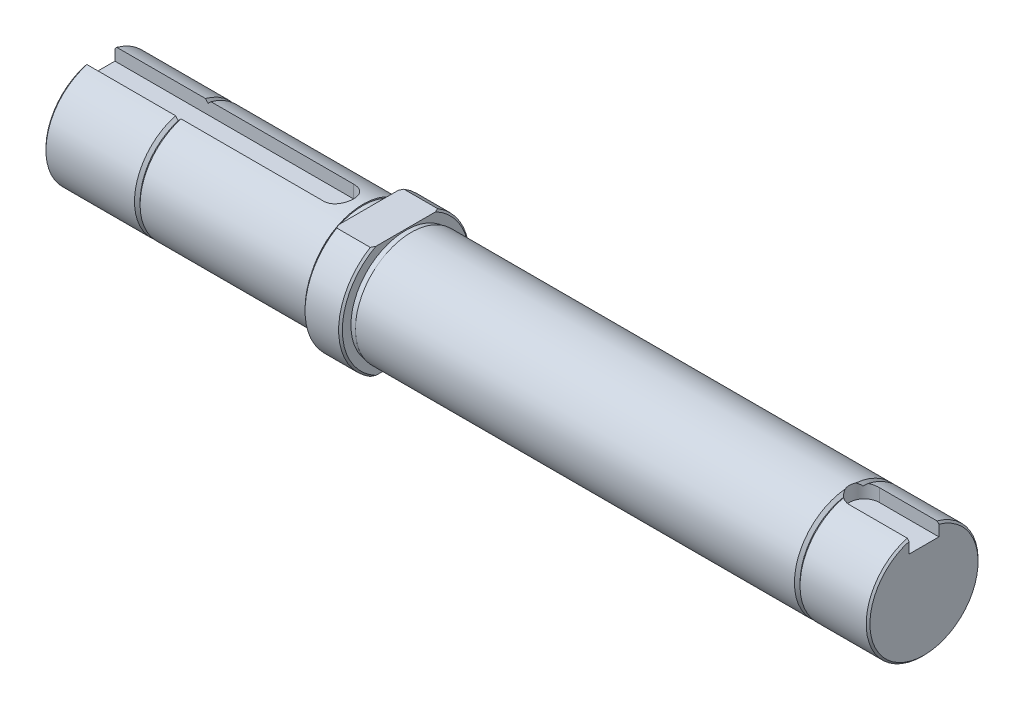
ISO-10303-21;
HEADER;
FILE_DESCRIPTION(('STEP AP214'),'2;1');
FILE_NAME('part.step','',(''),(''),'','','');
FILE_SCHEMA(('AUTOMOTIVE_DESIGN { 1 0 10303 214 1 1 1 1 }'));
ENDSEC;
DATA;
#1=APPLICATION_CONTEXT('core data for automotive mechanical design processes');
#2=APPLICATION_PROTOCOL_DEFINITION('international standard','automotive_design',2000,#1);
#3=PRODUCT_CONTEXT('',#1,'mechanical');
#4=PRODUCT('Part','Part','',(#3));
#5=PRODUCT_RELATED_PRODUCT_CATEGORY('part','',(#4));
#6=PRODUCT_DEFINITION_FORMATION('','',#4);
#7=PRODUCT_DEFINITION_CONTEXT('part definition',#1,'design');
#8=PRODUCT_DEFINITION('design','',#6,#7);
#9=PRODUCT_DEFINITION_SHAPE('','',#8);
#10=(LENGTH_UNIT() NAMED_UNIT(*) SI_UNIT(.MILLI.,.METRE.));
#11=(NAMED_UNIT(*) PLANE_ANGLE_UNIT() SI_UNIT($,.RADIAN.));
#12=(NAMED_UNIT(*) SI_UNIT($,.STERADIAN.) SOLID_ANGLE_UNIT());
#13=UNCERTAINTY_MEASURE_WITH_UNIT(LENGTH_MEASURE(1.E-05),#10,'distance_accuracy_value','');
#14=(GEOMETRIC_REPRESENTATION_CONTEXT(3) GLOBAL_UNCERTAINTY_ASSIGNED_CONTEXT((#13)) GLOBAL_UNIT_ASSIGNED_CONTEXT((#10,
#11,#12)) REPRESENTATION_CONTEXT('',''));
#15=CARTESIAN_POINT('',(0.,0.,0.));
#16=DIRECTION('',(0.,0.,1.));
#17=DIRECTION('',(1.,0.,0.));
#18=AXIS2_PLACEMENT_3D('',#15,#16,#17);
#19=CARTESIAN_POINT('',(221.,0.,0.));
#20=DIRECTION('',(-1.,0.,0.));
#21=DIRECTION('',(0.,0.,1.));
#22=AXIS2_PLACEMENT_3D('',#19,#20,#21);
#23=CYLINDRICAL_SURFACE('',#22,15.);
#24=CARTESIAN_POINT('',(83.5,0.,0.));
#25=DIRECTION('',(-1.,0.,0.));
#26=DIRECTION('',(0.,0.,1.));
#27=AXIS2_PLACEMENT_3D('',#24,#25,#26);
#28=CIRCLE('',#27,15.);
#29=CARTESIAN_POINT('',(83.5,0.,15.0000000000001));
#30=VERTEX_POINT('',#29);
#31=EDGE_CURVE('E651',#30,#30,#28,.T.);
#32=ORIENTED_EDGE('',*,*,#31,.F.);
#33=EDGE_LOOP('',(#32));
#34=FACE_BOUND('',#33,.T.);
#35=CARTESIAN_POINT('',(205.,14.456832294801,3.99999999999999));
#36=CARTESIAN_POINT('',(204.889641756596,14.4568189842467,4.00001309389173));
#37=CARTESIAN_POINT('',(204.779291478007,14.4580956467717,3.99543311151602));
#38=CARTESIAN_POINT('',(204.559421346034,14.4631301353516,3.97718874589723));
#39=CARTESIAN_POINT('',(204.44990134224,14.4668875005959,3.96352604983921));
#40=CARTESIAN_POINT('',(204.232698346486,14.4767740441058,3.9272569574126));
#41=CARTESIAN_POINT('',(204.125011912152,14.482898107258,3.90466984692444));
#42=CARTESIAN_POINT('',(203.912025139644,14.4973231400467,3.8507654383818));
#43=CARTESIAN_POINT('',(203.806724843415,14.5056241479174,3.81944798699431));
#44=CARTESIAN_POINT('',(203.495536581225,14.5334412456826,3.71275643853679));
#45=CARTESIAN_POINT('',(203.294125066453,14.5558829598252,3.62460332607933));
#46=CARTESIAN_POINT('',(202.908979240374,14.6060171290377,3.41695780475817));
#47=CARTESIAN_POINT('',(202.725250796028,14.6337113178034,3.29745504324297));
#48=CARTESIAN_POINT('',(202.376029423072,14.6920016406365,3.02730320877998));
#49=CARTESIAN_POINT('',(202.211038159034,14.7226489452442,2.87601544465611));
#50=CARTESIAN_POINT('',(201.908442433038,14.7829523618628,2.54795832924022));
#51=CARTESIAN_POINT('',(201.770842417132,14.8126083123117,2.37118484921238));
#52=CARTESIAN_POINT('',(201.524827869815,14.8681604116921,1.99367199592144));
#53=CARTESIAN_POINT('',(201.416916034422,14.8939887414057,1.79259414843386));
#54=CARTESIAN_POINT('',(201.236627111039,14.9383834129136,1.37435575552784));
#55=CARTESIAN_POINT('',(201.164242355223,14.9569513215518,1.15719869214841));
#56=CARTESIAN_POINT('',(201.058690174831,14.9843709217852,0.718234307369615));
#57=CARTESIAN_POINT('',(201.024662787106,14.9934353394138,0.496647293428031));
#58=CARTESIAN_POINT('',(200.994085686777,15.0015705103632,0.0507319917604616));
#59=CARTESIAN_POINT('',(200.997530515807,15.0006427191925,-0.173595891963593));
#60=CARTESIAN_POINT('',(201.041195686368,14.9890534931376,-0.612629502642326));
#61=CARTESIAN_POINT('',(201.080486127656,14.9786381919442,-0.827435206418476));
#62=CARTESIAN_POINT('',(201.193225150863,14.9495347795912,-1.24728467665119));
#63=CARTESIAN_POINT('',(201.266675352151,14.9308462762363,-1.4523279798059));
#64=CARTESIAN_POINT('',(201.446359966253,14.8869312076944,-1.84920963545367));
#65=CARTESIAN_POINT('',(201.55291337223,14.8616414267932,-2.04089626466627));
#66=CARTESIAN_POINT('',(201.795542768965,14.8072486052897,-2.40398441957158));
#67=CARTESIAN_POINT('',(201.931623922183,14.7781448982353,-2.57538239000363));
#68=CARTESIAN_POINT('',(202.234327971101,14.7182294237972,-2.8985493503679));
#69=CARTESIAN_POINT('',(202.401758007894,14.6873926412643,-3.04955722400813));
#70=CARTESIAN_POINT('',(202.760042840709,14.6282716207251,-3.32161448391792));
#71=CARTESIAN_POINT('',(202.950904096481,14.5999880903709,-3.44265558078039));
#72=CARTESIAN_POINT('',(203.251353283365,14.5618587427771,-3.59932937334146));
#73=CARTESIAN_POINT('',(203.354288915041,14.5498268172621,-3.64754371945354));
#74=CARTESIAN_POINT('',(203.564046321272,14.5275984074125,-3.73509417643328));
#75=CARTESIAN_POINT('',(203.670866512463,14.5174011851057,-3.77443385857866));
#76=CARTESIAN_POINT('',(203.88751941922,14.4991713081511,-3.84386783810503));
#77=CARTESIAN_POINT('',(203.997348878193,14.4911364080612,-3.87397173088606));
#78=CARTESIAN_POINT('',(204.219275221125,14.4774747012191,-3.92471856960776));
#79=CARTESIAN_POINT('',(204.33137102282,14.4718467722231,-3.9453659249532));
#80=CARTESIAN_POINT('',(204.536251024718,14.4639761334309,-3.97411378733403));
#81=CARTESIAN_POINT('',(204.628796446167,14.4613012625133,-3.98382319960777));
#82=CARTESIAN_POINT('',(204.81422535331,14.4577275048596,-3.99676420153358));
#83=CARTESIAN_POINT('',(204.907108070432,14.4568258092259,-4.00000603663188));
#84=CARTESIAN_POINT('',(205.,14.4568322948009,-4.00000000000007));
#85=B_SPLINE_CURVE_WITH_KNOTS('',3,(#35,#36,#37,#38,#39,#40,#41,#42,#43,#44,#45,#46,#47,#48,#49,
#50,#51,#52,#53,#54,#55,#56,#57,#58,#59,#60,#61,#62,#63,#64,#65,#66,#67,#68,#69,#70,#71,#72,#73,
#74,#75,#76,#77,#78,#79,#80,#81,#82,#83,#84),.UNSPECIFIED.,.F.,.F.,(4,2,2,2,2,2,2,2,2,2,2,2,2,2,
2,2,2,2,2,2,2,2,2,2,4),(0.,0.330958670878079,0.661855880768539,0.992041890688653,
1.32223370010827,1.98190700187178,2.64179842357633,3.31649637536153,3.99130375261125,
4.67691814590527,5.36238449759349,6.03215661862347,6.701831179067,7.35461236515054,
8.00742449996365,8.66673340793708,9.32615767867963,10.005759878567,10.6855498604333,
11.0281077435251,11.3705275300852,11.7125903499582,12.0544935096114,12.3335333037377,
12.6121307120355),.UNSPECIFIED.);
#86=CARTESIAN_POINT('',(201.25,14.9352770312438,1.39194109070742));
#87=VERTEX_POINT('',#86);
#88=CARTESIAN_POINT('',(201.25,14.9352770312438,-1.39194109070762));
#89=VERTEX_POINT('',#88);
#90=EDGE_CURVE('E257',#87,#89,#85,.T.);
#91=ORIENTED_EDGE('',*,*,#90,.T.);
#92=CARTESIAN_POINT('',(201.25,0.,0.));
#93=DIRECTION('',(-1.,0.,0.));
#94=DIRECTION('',(0.,0.,1.));
#95=AXIS2_PLACEMENT_3D('',#92,#93,#94);
#96=CIRCLE('',#95,15.);
#97=EDGE_CURVE('E252',#89,#87,#96,.T.);
#98=ORIENTED_EDGE('',*,*,#97,.T.);
#99=EDGE_LOOP('',(#91,#98));
#100=FACE_BOUND('',#99,.T.);
#101=ADVANCED_FACE('F42',(#34,#100),#23,.T.);
#102=CARTESIAN_POINT('',(221.,0.,0.));
#103=DIRECTION('',(-1.,0.,0.));
#104=DIRECTION('',(0.,0.,1.));
#105=AXIS2_PLACEMENT_3D('',#102,#103,#104);
#106=CYLINDRICAL_SURFACE('',#105,15.);
#107=DIRECTION('',(-1.,0.,0.));
#108=VECTOR('',#107,1.);
#109=CARTESIAN_POINT('',(221.,14.4568322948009,-4.00000000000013));
#110=LINE('',#109,#108);
#111=CARTESIAN_POINT('',(0.5,14.4568322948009,-4.00000000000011));
#112=VERTEX_POINT('',#111);
#113=CARTESIAN_POINT('',(24.25,14.4568322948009,-4.00000000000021));
#114=VERTEX_POINT('',#113);
#115=EDGE_CURVE('E368',#112,#114,#110,.F.);
#116=ORIENTED_EDGE('',*,*,#115,.T.);
#117=CARTESIAN_POINT('',(24.25,0.,0.));
#118=DIRECTION('',(-1.,0.,0.));
#119=DIRECTION('',(0.,0.,1.));
#120=AXIS2_PLACEMENT_3D('',#117,#118,#119);
#121=CIRCLE('',#120,15.);
#122=CARTESIAN_POINT('',(24.25,14.4568322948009,3.99999999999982));
#123=VERTEX_POINT('',#122);
#124=EDGE_CURVE('E304',#114,#123,#121,.T.);
#125=ORIENTED_EDGE('',*,*,#124,.T.);
#126=DIRECTION('',(-1.,0.,0.));
#127=VECTOR('',#126,1.);
#128=CARTESIAN_POINT('',(221.,14.4568322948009,3.99999999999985));
#129=LINE('',#128,#127);
#130=CARTESIAN_POINT('',(0.5,14.4568322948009,3.99999999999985));
#131=VERTEX_POINT('',#130);
#132=EDGE_CURVE('E360',#123,#131,#129,.T.);
#133=ORIENTED_EDGE('',*,*,#132,.T.);
#134=CARTESIAN_POINT('',(0.5,0.,0.));
#135=DIRECTION('',(-1.,0.,0.));
#136=DIRECTION('',(0.,0.,1.));
#137=AXIS2_PLACEMENT_3D('',#134,#135,#136);
#138=CIRCLE('',#137,15.);
#139=EDGE_CURVE('E526',#112,#131,#138,.T.);
#140=ORIENTED_EDGE('',*,*,#139,.F.);
#141=EDGE_LOOP('',(#116,#125,#133,#140));
#142=FACE_BOUND('',#141,.T.);
#143=ADVANCED_FACE('F349',(#142),#106,.T.);
#144=CARTESIAN_POINT('',(72.,14.7,-1.80411241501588E-13));
#145=DIRECTION('',(1.,0.,0.));
#146=DIRECTION('',(0.,0.,-1.));
#147=AXIS2_PLACEMENT_3D('',#144,#145,#146);
#148=PLANE('',#147);
#149=CARTESIAN_POINT('',(72.,0.,0.));
#150=DIRECTION('',(-1.,0.,0.));
#151=DIRECTION('',(0.,0.,1.));
#152=AXIS2_PLACEMENT_3D('',#149,#150,#151);
#153=CIRCLE('',#152,14.7);
#154=CARTESIAN_POINT('',(72.,0.,14.7000000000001));
#155=VERTEX_POINT('',#154);
#156=EDGE_CURVE('E515',#155,#155,#153,.T.);
#157=ORIENTED_EDGE('',*,*,#156,.F.);
#158=EDGE_LOOP('',(#157));
#159=FACE_BOUND('',#158,.T.);
#160=DIRECTION('',(0.,0.,1.));
#161=VECTOR('',#160,1.);
#162=CARTESIAN_POINT('',(72.,-15.,-35.0000000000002));
#163=LINE('',#162,#161);
#164=CARTESIAN_POINT('',(72.,-15.,-8.00000000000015));
#165=VERTEX_POINT('',#164);
#166=CARTESIAN_POINT('',(72.,-15.0000000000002,7.99999999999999));
#167=VERTEX_POINT('',#166);
#168=EDGE_CURVE('E480',#165,#167,#163,.T.);
#169=ORIENTED_EDGE('',*,*,#168,.T.);
#170=CARTESIAN_POINT('',(72.,0.,0.));
#171=DIRECTION('',(-1.,0.,0.));
#172=DIRECTION('',(0.,0.,1.));
#173=AXIS2_PLACEMENT_3D('',#170,#171,#172);
#174=CIRCLE('',#173,17.);
#175=CARTESIAN_POINT('',(72.,15.,8.00000000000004));
#176=VERTEX_POINT('',#175);
#177=EDGE_CURVE('E507',#167,#176,#174,.T.);
#178=ORIENTED_EDGE('',*,*,#177,.T.);
#179=DIRECTION('',(0.,0.,-1.));
#180=VECTOR('',#179,1.);
#181=CARTESIAN_POINT('',(71.9999999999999,15.,35.0000000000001));
#182=LINE('',#181,#180);
#183=CARTESIAN_POINT('',(72.,15.,-8.00000000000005));
#184=VERTEX_POINT('',#183);
#185=EDGE_CURVE('E475',#176,#184,#182,.T.);
#186=ORIENTED_EDGE('',*,*,#185,.T.);
#187=EDGE_CURVE('E514',#184,#165,#174,.T.);
#188=ORIENTED_EDGE('',*,*,#187,.T.);
#189=EDGE_LOOP('',(#169,#178,#186,#188));
#190=FACE_BOUND('',#189,.T.);
#191=ADVANCED_FACE('F458',(#159,#190),#148,.F.);
#192=CARTESIAN_POINT('',(72.5,0.,0.));
#193=DIRECTION('',(1.,0.,0.));
#194=DIRECTION('',(0.,0.,-1.));
#195=AXIS2_PLACEMENT_3D('',#192,#193,#194);
#196=CONICAL_SURFACE('',#195,17.5,0.785398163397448);
#197=CARTESIAN_POINT('',(93.5023427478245,-15.0000000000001,35.4602650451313));
#198=CARTESIAN_POINT('',(93.017338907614,-15.0000000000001,34.9336378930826));
#199=CARTESIAN_POINT('',(92.5332062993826,-15.0000000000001,34.4062063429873));
#200=CARTESIAN_POINT('',(91.5669590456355,-15.0000000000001,33.3494908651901));
#201=CARTESIAN_POINT('',(91.0848444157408,-15.0000000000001,32.8202069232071));
#202=CARTESIAN_POINT('',(90.1228076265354,-15.0000000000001,31.7594315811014));
#203=CARTESIAN_POINT('',(89.6428859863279,-15.0000000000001,31.2279397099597));
#204=CARTESIAN_POINT('',(88.6856957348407,-15.0000000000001,30.1625732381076));
#205=CARTESIAN_POINT('',(88.208427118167,-15.0000000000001,29.6286986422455));
#206=CARTESIAN_POINT('',(87.2540668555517,-15.0000000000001,28.5549598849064));
#207=CARTESIAN_POINT('',(86.7769939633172,-15.0000000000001,28.0150790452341));
#208=CARTESIAN_POINT('',(85.8264835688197,-15.0000000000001,26.9321265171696));
#209=CARTESIAN_POINT('',(85.3530460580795,-15.0000000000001,26.3890548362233));
#210=CARTESIAN_POINT('',(84.4105070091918,-15.,25.2992637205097));
#211=CARTESIAN_POINT('',(83.9414049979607,-15.,24.7525446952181));
#212=CARTESIAN_POINT('',(83.0082964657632,-15.0000000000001,23.6547739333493));
#213=CARTESIAN_POINT('',(82.5442899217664,-15.0000000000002,23.1037222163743));
#214=CARTESIAN_POINT('',(81.708212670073,-15.0000000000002,22.0995665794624));
#215=CARTESIAN_POINT('',(81.3351069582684,-15.0000000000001,21.6473248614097));
#216=CARTESIAN_POINT('',(80.5936589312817,-15.,20.7389550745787));
#217=CARTESIAN_POINT('',(80.2253165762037,-15.,20.2828270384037));
#218=CARTESIAN_POINT('',(79.4941582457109,-15.0000000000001,19.365958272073));
#219=CARTESIAN_POINT('',(79.131343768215,-15.0000000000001,18.9052163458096));
#220=CARTESIAN_POINT('',(78.4124270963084,-15.0000000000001,17.978521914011));
#221=CARTESIAN_POINT('',(78.0563248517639,-15.0000000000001,17.5125694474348));
#222=CARTESIAN_POINT('',(77.3525866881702,-15.0000000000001,16.5751005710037));
#223=CARTESIAN_POINT('',(77.0049419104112,-15.0000000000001,16.1035908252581));
#224=CARTESIAN_POINT('',(76.3194496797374,-15.0000000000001,15.1534548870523));
#225=CARTESIAN_POINT('',(75.9816026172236,-15.0000000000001,14.6748284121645));
#226=CARTESIAN_POINT('',(75.3181270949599,-15.0000000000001,13.7094572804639));
#227=CARTESIAN_POINT('',(74.9924934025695,-15.,13.2227162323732));
#228=CARTESIAN_POINT('',(74.3562790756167,-15.0000000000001,12.2395282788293));
#229=CARTESIAN_POINT('',(74.0456967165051,-15.0000000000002,11.7430824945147));
#230=CARTESIAN_POINT('',(73.446170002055,-15.0000000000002,10.743359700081));
#231=CARTESIAN_POINT('',(73.1570545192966,-15.0000000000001,10.240185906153));
#232=CARTESIAN_POINT('',(72.6023197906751,-15.,9.22087395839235));
#233=CARTESIAN_POINT('',(72.3367030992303,-15.,8.70473440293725));
#234=CARTESIAN_POINT('',(71.8357081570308,-15.0000000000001,7.65844656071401));
#235=CARTESIAN_POINT('',(71.6003015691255,-15.0000000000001,7.12831197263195));
#236=CARTESIAN_POINT('',(71.1676233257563,-15.,6.05261751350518));
#237=CARTESIAN_POINT('',(70.9703406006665,-15.,5.50706217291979));
#238=CARTESIAN_POINT('',(70.6606379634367,-15.,4.5194797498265));
#239=CARTESIAN_POINT('',(70.5390920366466,-15.,4.08033088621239));
#240=CARTESIAN_POINT('',(70.3302221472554,-15.0000000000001,3.1939084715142));
#241=CARTESIAN_POINT('',(70.2428936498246,-15.0000000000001,2.74663600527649));
#242=CARTESIAN_POINT('',(70.1068398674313,-15.0000000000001,1.84752628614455));
#243=CARTESIAN_POINT('',(70.058001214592,-15.,1.39570643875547));
#244=CARTESIAN_POINT('',(70.0011725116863,-15.0000000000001,0.489479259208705));
#245=CARTESIAN_POINT('',(69.9931808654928,-15.0000000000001,0.0350720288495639));
#246=CARTESIAN_POINT('',(70.0185229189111,-15.0000000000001,-0.873143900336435));
#247=CARTESIAN_POINT('',(70.051908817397,-15.0000000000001,-1.32695111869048));
#248=CARTESIAN_POINT('',(70.1582056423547,-15.,-2.22987551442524));
#249=CARTESIAN_POINT('',(70.2311198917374,-15.0000000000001,-2.67899229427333));
#250=CARTESIAN_POINT('',(70.4130410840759,-15.,-3.57117607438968));
#251=CARTESIAN_POINT('',(70.5221571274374,-15.,-4.01422051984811));
#252=CARTESIAN_POINT('',(70.7717388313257,-15.0000000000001,-4.89127914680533));
#253=CARTESIAN_POINT('',(70.9122049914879,-15.0000000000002,-5.32529318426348));
#254=CARTESIAN_POINT('',(71.2464935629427,-15.0000000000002,-6.25861031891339));
#255=CARTESIAN_POINT('',(71.4453490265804,-15.0000000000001,-6.75609812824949));
#256=CARTESIAN_POINT('',(71.8726339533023,-15.,-7.73831424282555));
#257=CARTESIAN_POINT('',(72.1010769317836,-15.,-8.22303659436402));
#258=CARTESIAN_POINT('',(72.5819816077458,-15.0000000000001,-9.18140393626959));
#259=CARTESIAN_POINT('',(72.8344852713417,-15.0000000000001,-9.65502770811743));
#260=CARTESIAN_POINT('',(73.3583863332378,-15.0000000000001,-10.5915511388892));
#261=CARTESIAN_POINT('',(73.6297810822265,-15.0000000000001,-11.0544522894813));
#262=CARTESIAN_POINT('',(74.191139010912,-15.0000000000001,-11.976440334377));
#263=CARTESIAN_POINT('',(74.4812858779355,-15.0000000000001,-12.4354148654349));
#264=CARTESIAN_POINT('',(75.0741970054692,-15.0000000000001,-13.3451248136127));
#265=CARTESIAN_POINT('',(75.3769615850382,-15.0000000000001,-13.7958600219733));
#266=CARTESIAN_POINT('',(75.9924752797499,-15.0000000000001,-14.6897557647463));
#267=CARTESIAN_POINT('',(76.3052137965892,-15.0000000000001,-15.1329236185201));
#268=CARTESIAN_POINT('',(76.9391701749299,-15.0000000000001,-16.0131314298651));
#269=CARTESIAN_POINT('',(77.2603879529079,-15.0000000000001,-16.4501714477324));
#270=CARTESIAN_POINT('',(77.8978733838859,-15.0000000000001,-17.3028829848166));
#271=CARTESIAN_POINT('',(78.2138843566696,-15.0000000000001,-17.7187467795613));
#272=CARTESIAN_POINT('',(78.851458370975,-15.0000000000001,-18.5462016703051));
#273=CARTESIAN_POINT('',(79.1730215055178,-15.0000000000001,-18.9577926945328));
#274=CARTESIAN_POINT('',(79.8208971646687,-15.0000000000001,-19.7772568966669));
#275=CARTESIAN_POINT('',(80.1472099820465,-15.0000000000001,-20.1851298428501));
#276=CARTESIAN_POINT('',(80.8039062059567,-15.0000000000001,-20.997587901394));
#277=CARTESIAN_POINT('',(81.1342896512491,-15.0000000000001,-21.4021729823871));
#278=CARTESIAN_POINT('',(82.1311653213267,-15.0000000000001,-22.6121614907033));
#279=CARTESIAN_POINT('',(82.8029271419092,-15.0000000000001,-23.4132249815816));
#280=CARTESIAN_POINT('',(84.1571278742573,-15.0000000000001,-25.0062738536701));
#281=CARTESIAN_POINT('',(84.8395669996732,-15.0000000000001,-25.798259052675));
#282=CARTESIAN_POINT('',(85.8529461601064,-15.0000000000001,-26.9617896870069));
#283=CARTESIAN_POINT('',(86.1806601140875,-15.0000000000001,-27.3361514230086));
#284=CARTESIAN_POINT('',(86.8377824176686,-15.0000000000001,-28.0833767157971));
#285=CARTESIAN_POINT('',(87.1671907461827,-15.0000000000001,-28.4562402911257));
#286=CARTESIAN_POINT('',(88.1577074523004,-15.0000000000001,-29.5728210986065));
#287=CARTESIAN_POINT('',(88.8210965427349,-15.0000000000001,-30.3145157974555));
#288=CARTESIAN_POINT('',(90.151818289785,-15.0000000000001,-31.7923516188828));
#289=CARTESIAN_POINT('',(90.8191435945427,-15.0000000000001,-32.5284993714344));
#290=CARTESIAN_POINT('',(92.1578782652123,-15.0000000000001,-33.9970274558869));
#291=CARTESIAN_POINT('',(92.8292874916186,-15.0000000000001,-34.7294079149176));
#292=CARTESIAN_POINT('',(93.5023427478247,-15.0000000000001,-35.4602650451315));
#293=B_SPLINE_CURVE_WITH_KNOTS('',3,(#197,#198,#199,#200,#201,#202,#203,#204,#205,#206,#207,
#208,#209,#210,#211,#212,#213,#214,#215,#216,#217,#218,#219,#220,#221,#222,#223,#224,#225,#226,
#227,#228,#229,#230,#231,#232,#233,#234,#235,#236,#237,#238,#239,#240,#241,#242,#243,#244,#245,
#246,#247,#248,#249,#250,#251,#252,#253,#254,#255,#256,#257,#258,#259,#260,#261,#262,#263,#264,
#265,#266,#267,#268,#269,#270,#271,#272,#273,#274,#275,#276,#277,#278,#279,#280,#281,#282,#283,
#284,#285,#286,#287,#288,#289,#290,#291,#292),.UNSPECIFIED.,.F.,.F.,(4,2,2,2,2,2,2,2,2,2,2,2,2,
2,2,2,2,2,2,2,2,2,2,2,2,2,2,2,2,2,2,2,2,2,2,2,2,2,2,2,2,2,2,2,2,2,2,4),(0.,2.14781033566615,
4.29563726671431,6.44394869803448,8.59225576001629,10.7536370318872,12.9150132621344,
15.0761507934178,17.2372785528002,18.9961075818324,20.7549218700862,22.5142045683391,
24.2734741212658,26.0308138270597,27.7882234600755,29.5448713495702,31.3013174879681,
33.0417864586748,34.7824443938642,36.5214574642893,38.259964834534,39.6257770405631,
40.9914081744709,42.3530017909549,43.7145422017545,45.0778019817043,46.4411763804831,
47.808697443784,49.1762403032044,50.7822986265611,52.3890931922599,53.9987434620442,
55.6081684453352,57.2368994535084,58.8656716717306,60.4927673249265,62.119846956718,
63.6867170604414,65.2536134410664,66.8206068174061,68.3876151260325,71.5238282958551,
74.6601043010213,76.1527113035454,77.6452997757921,80.6305269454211,83.6113045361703,
86.591980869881),.UNSPECIFIED.);
#294=CARTESIAN_POINT('',(72.5,-15.0000000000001,9.01387818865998));
#295=VERTEX_POINT('',#294);
#296=EDGE_CURVE('E444',#295,#167,#293,.T.);
#297=ORIENTED_EDGE('',*,*,#296,.F.);
#298=CARTESIAN_POINT('',(72.5,0.,0.));
#299=DIRECTION('',(-1.,0.,0.));
#300=DIRECTION('',(0.,0.,1.));
#301=AXIS2_PLACEMENT_3D('',#298,#299,#300);
#302=CIRCLE('',#301,17.5);
#303=CARTESIAN_POINT('',(72.5,15.,9.01387818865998));
#304=VERTEX_POINT('',#303);
#305=EDGE_CURVE('E498',#295,#304,#302,.T.);
#306=ORIENTED_EDGE('',*,*,#305,.T.);
#307=CARTESIAN_POINT('',(93.5023427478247,15.,-35.4602650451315));
#308=CARTESIAN_POINT('',(93.0173389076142,15.,-34.9336378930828));
#309=CARTESIAN_POINT('',(92.5332062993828,15.,-34.4062063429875));
#310=CARTESIAN_POINT('',(91.5669590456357,15.,-33.3494908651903));
#311=CARTESIAN_POINT('',(91.084844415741,15.,-32.8202069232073));
#312=CARTESIAN_POINT('',(90.1228076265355,15.,-31.7594315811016));
#313=CARTESIAN_POINT('',(89.6428859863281,15.,-31.2279397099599));
#314=CARTESIAN_POINT('',(88.6856957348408,15.,-30.1625732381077));
#315=CARTESIAN_POINT('',(88.2084271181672,15.,-29.6286986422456));
#316=CARTESIAN_POINT('',(87.2540668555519,15.,-28.5549598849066));
#317=CARTESIAN_POINT('',(86.7769939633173,15.,-28.0150790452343));
#318=CARTESIAN_POINT('',(85.8264835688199,15.,-26.9321265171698));
#319=CARTESIAN_POINT('',(85.3530460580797,15.,-26.3890548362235));
#320=CARTESIAN_POINT('',(84.4105070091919,15.,-25.2992637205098));
#321=CARTESIAN_POINT('',(83.9414049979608,15.0000000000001,-24.7525446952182));
#322=CARTESIAN_POINT('',(83.0082964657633,15.,-23.6547739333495));
#323=CARTESIAN_POINT('',(82.5442899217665,14.9999999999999,-23.1037222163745));
#324=CARTESIAN_POINT('',(81.7082126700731,15.,-22.0995665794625));
#325=CARTESIAN_POINT('',(81.3351069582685,15.,-21.6473248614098));
#326=CARTESIAN_POINT('',(80.5936589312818,15.,-20.7389550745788));
#327=CARTESIAN_POINT('',(80.2253165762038,15.,-20.2828270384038));
#328=CARTESIAN_POINT('',(79.494158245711,15.,-19.3659582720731));
#329=CARTESIAN_POINT('',(79.1313437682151,15.,-18.9052163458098));
#330=CARTESIAN_POINT('',(78.4124270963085,15.,-17.9785219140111));
#331=CARTESIAN_POINT('',(78.056324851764,15.,-17.5125694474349));
#332=CARTESIAN_POINT('',(77.3525866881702,15.,-16.5751005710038));
#333=CARTESIAN_POINT('',(77.0049419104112,15.,-16.1035908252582));
#334=CARTESIAN_POINT('',(76.3194496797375,15.,-15.1534548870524));
#335=CARTESIAN_POINT('',(75.9816026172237,15.,-14.6748284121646));
#336=CARTESIAN_POINT('',(75.3181270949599,15.,-13.709457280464));
#337=CARTESIAN_POINT('',(74.9924934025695,15.,-13.2227162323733));
#338=CARTESIAN_POINT('',(74.3562790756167,15.,-12.2395282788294));
#339=CARTESIAN_POINT('',(74.0456967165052,15.,-11.7430824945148));
#340=CARTESIAN_POINT('',(73.446170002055,15.,-10.7433597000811));
#341=CARTESIAN_POINT('',(73.1570545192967,15.,-10.2401859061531));
#342=CARTESIAN_POINT('',(72.6023197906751,15.,-9.22087395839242));
#343=CARTESIAN_POINT('',(72.3367030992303,15.,-8.70473440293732));
#344=CARTESIAN_POINT('',(71.8357081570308,15.,-7.65844656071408));
#345=CARTESIAN_POINT('',(71.6003015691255,15.,-7.12831197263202));
#346=CARTESIAN_POINT('',(71.1676233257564,15.,-6.05261751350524));
#347=CARTESIAN_POINT('',(70.9703406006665,15.,-5.50706217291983));
#348=CARTESIAN_POINT('',(70.6606379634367,15.,-4.51947974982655));
#349=CARTESIAN_POINT('',(70.5390920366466,15.,-4.08033088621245));
#350=CARTESIAN_POINT('',(70.3302221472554,15.,-3.19390847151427));
#351=CARTESIAN_POINT('',(70.2428936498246,15.,-2.74663600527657));
#352=CARTESIAN_POINT('',(70.1068398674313,15.,-1.84752628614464));
#353=CARTESIAN_POINT('',(70.058001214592,15.,-1.39570643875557));
#354=CARTESIAN_POINT('',(70.0011725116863,15.,-0.489479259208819));
#355=CARTESIAN_POINT('',(69.9931808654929,15.,-0.0350720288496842));
#356=CARTESIAN_POINT('',(70.0185229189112,15.,0.87314390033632));
#357=CARTESIAN_POINT('',(70.051908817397,15.,1.32695111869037));
#358=CARTESIAN_POINT('',(70.1582056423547,15.,2.22987551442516));
#359=CARTESIAN_POINT('',(70.2311198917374,15.,2.67899229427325));
#360=CARTESIAN_POINT('',(70.4130410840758,15.,3.57117607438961));
#361=CARTESIAN_POINT('',(70.5221571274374,15.,4.01422051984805));
#362=CARTESIAN_POINT('',(70.7717388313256,15.,4.89127914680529));
#363=CARTESIAN_POINT('',(70.9122049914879,15.,5.32529318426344));
#364=CARTESIAN_POINT('',(71.2464935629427,15.,6.25861031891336));
#365=CARTESIAN_POINT('',(71.4453490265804,15.,6.75609812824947));
#366=CARTESIAN_POINT('',(71.8726339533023,15.,7.73831424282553));
#367=CARTESIAN_POINT('',(72.1010769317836,15.,8.22303659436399));
#368=CARTESIAN_POINT('',(72.5819816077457,15.,9.18140393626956));
#369=CARTESIAN_POINT('',(72.8344852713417,15.,9.65502770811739));
#370=CARTESIAN_POINT('',(73.3583863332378,15.,10.5915511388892));
#371=CARTESIAN_POINT('',(73.6297810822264,15.,11.0544522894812));
#372=CARTESIAN_POINT('',(74.1911390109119,15.,11.9764403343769));
#373=CARTESIAN_POINT('',(74.4812858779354,15.,12.4354148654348));
#374=CARTESIAN_POINT('',(75.0741970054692,15.,13.3451248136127));
#375=CARTESIAN_POINT('',(75.3769615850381,15.,13.7958600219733));
#376=CARTESIAN_POINT('',(75.9924752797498,15.,14.6897557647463));
#377=CARTESIAN_POINT('',(76.3052137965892,15.,15.1329236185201));
#378=CARTESIAN_POINT('',(76.9391701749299,15.,16.013131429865));
#379=CARTESIAN_POINT('',(77.2603879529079,15.,16.4501714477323));
#380=CARTESIAN_POINT('',(77.8978733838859,15.,17.3028829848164));
#381=CARTESIAN_POINT('',(78.2138843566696,15.,17.7187467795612));
#382=CARTESIAN_POINT('',(78.8514583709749,15.,18.546201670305));
#383=CARTESIAN_POINT('',(79.1730215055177,15.,18.9577926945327));
#384=CARTESIAN_POINT('',(79.8208971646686,15.,19.7772568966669));
#385=CARTESIAN_POINT('',(80.1472099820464,15.,20.18512984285));
#386=CARTESIAN_POINT('',(80.8039062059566,15.,20.9975879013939));
#387=CARTESIAN_POINT('',(81.134289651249,15.,21.4021729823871));
#388=CARTESIAN_POINT('',(82.1311653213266,15.,22.6121614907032));
#389=CARTESIAN_POINT('',(82.8029271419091,15.,23.4132249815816));
#390=CARTESIAN_POINT('',(84.1571278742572,15.,25.00627385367));
#391=CARTESIAN_POINT('',(84.8395669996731,15.,25.7982590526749));
#392=CARTESIAN_POINT('',(85.8529461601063,15.,26.9617896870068));
#393=CARTESIAN_POINT('',(86.1806601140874,15.,27.3361514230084));
#394=CARTESIAN_POINT('',(86.8377824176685,15.,28.0833767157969));
#395=CARTESIAN_POINT('',(87.1671907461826,15.,28.4562402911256));
#396=CARTESIAN_POINT('',(88.1577074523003,15.,29.5728210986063));
#397=CARTESIAN_POINT('',(88.8210965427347,15.,30.3145157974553));
#398=CARTESIAN_POINT('',(90.1518182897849,15.,31.7923516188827));
#399=CARTESIAN_POINT('',(90.8191435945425,15.,32.5284993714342));
#400=CARTESIAN_POINT('',(92.1578782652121,15.,33.9970274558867));
#401=CARTESIAN_POINT('',(92.8292874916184,15.,34.7294079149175));
#402=CARTESIAN_POINT('',(93.5023427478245,15.,35.4602650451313));
#403=B_SPLINE_CURVE_WITH_KNOTS('',3,(#307,#308,#309,#310,#311,#312,#313,#314,#315,#316,#317,
#318,#319,#320,#321,#322,#323,#324,#325,#326,#327,#328,#329,#330,#331,#332,#333,#334,#335,#336,
#337,#338,#339,#340,#341,#342,#343,#344,#345,#346,#347,#348,#349,#350,#351,#352,#353,#354,#355,
#356,#357,#358,#359,#360,#361,#362,#363,#364,#365,#366,#367,#368,#369,#370,#371,#372,#373,#374,
#375,#376,#377,#378,#379,#380,#381,#382,#383,#384,#385,#386,#387,#388,#389,#390,#391,#392,#393,
#394,#395,#396,#397,#398,#399,#400,#401,#402),.UNSPECIFIED.,.F.,.F.,(4,2,2,2,2,2,2,2,2,2,2,2,2,
2,2,2,2,2,2,2,2,2,2,2,2,2,2,2,2,2,2,2,2,2,2,2,2,2,2,2,2,2,2,2,2,2,2,4),(0.,2.14781033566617,
4.29563726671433,6.44394869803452,8.59225576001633,10.7536370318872,12.9150132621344,
15.0761507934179,17.2372785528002,18.9961075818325,20.7549218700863,22.5142045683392,
24.2734741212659,26.0308138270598,27.7882234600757,29.5448713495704,31.3013174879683,
33.041786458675,34.7824443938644,36.5214574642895,38.2599648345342,39.6257770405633,
40.991408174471,42.353001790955,43.7145422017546,45.0778019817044,46.4411763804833,
47.8086974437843,49.1762403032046,50.7822986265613,52.3890931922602,53.9987434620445,
55.6081684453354,57.2368994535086,58.8656716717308,60.4927673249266,62.1198469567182,
63.6867170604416,65.2536134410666,66.8206068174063,68.3876151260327,71.5238282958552,
74.6601043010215,76.1527113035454,77.6452997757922,80.6305269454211,83.6113045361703,
86.5919808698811),.UNSPECIFIED.);
#404=EDGE_CURVE('E429',#176,#304,#403,.T.);
#405=ORIENTED_EDGE('',*,*,#404,.F.);
#406=ORIENTED_EDGE('',*,*,#177,.F.);
#407=EDGE_LOOP('',(#297,#306,#405,#406));
#408=FACE_BOUND('',#407,.T.);
#409=ADVANCED_FACE('F453',(#408),#196,.T.);
#410=CARTESIAN_POINT('',(72.5,-15.0000000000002,-9.01387818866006));
#411=VERTEX_POINT('',#410);
#412=EDGE_CURVE('E450',#165,#411,#293,.T.);
#413=ORIENTED_EDGE('',*,*,#412,.F.);
#414=ORIENTED_EDGE('',*,*,#187,.F.);
#415=CARTESIAN_POINT('',(72.5,14.9999999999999,-9.01387818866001));
#416=VERTEX_POINT('',#415);
#417=EDGE_CURVE('E461',#416,#184,#403,.T.);
#418=ORIENTED_EDGE('',*,*,#417,.F.);
#419=EDGE_CURVE('E502',#416,#411,#302,.T.);
#420=ORIENTED_EDGE('',*,*,#419,.T.);
#421=EDGE_LOOP('',(#413,#414,#418,#420));
#422=FACE_BOUND('',#421,.T.);
#423=ADVANCED_FACE('F457',(#422),#196,.T.);
#424=CARTESIAN_POINT('',(221.,0.,0.));
#425=DIRECTION('',(-1.,0.,0.));
#426=DIRECTION('',(0.,0.,1.));
#427=AXIS2_PLACEMENT_3D('',#424,#425,#426);
#428=CYLINDRICAL_SURFACE('',#427,17.5);
#429=DIRECTION('',(-1.,0.,0.));
#430=VECTOR('',#429,1.);
#431=CARTESIAN_POINT('',(221.,-15.,9.01387818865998));
#432=LINE('',#431,#430);
#433=CARTESIAN_POINT('',(81.5,-15.,9.01387818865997));
#434=VERTEX_POINT('',#433);
#435=EDGE_CURVE('E428',#434,#295,#432,.T.);
#436=ORIENTED_EDGE('',*,*,#435,.F.);
#437=CARTESIAN_POINT('',(81.5,0.,0.));
#438=DIRECTION('',(-1.,0.,0.));
#439=DIRECTION('',(0.,0.,1.));
#440=AXIS2_PLACEMENT_3D('',#437,#438,#439);
#441=CIRCLE('',#440,17.5);
#442=CARTESIAN_POINT('',(81.5,14.9999999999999,9.01387818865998));
#443=VERTEX_POINT('',#442);
#444=EDGE_CURVE('E500',#434,#443,#441,.T.);
#445=ORIENTED_EDGE('',*,*,#444,.T.);
#446=DIRECTION('',(-1.,0.,0.));
#447=VECTOR('',#446,1.);
#448=CARTESIAN_POINT('',(221.,15.,9.01387818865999));
#449=LINE('',#448,#447);
#450=EDGE_CURVE('E431',#304,#443,#449,.F.);
#451=ORIENTED_EDGE('',*,*,#450,.F.);
#452=ORIENTED_EDGE('',*,*,#305,.F.);
#453=EDGE_LOOP('',(#436,#445,#451,#452));
#454=FACE_BOUND('',#453,.T.);
#455=ADVANCED_FACE('F409',(#454),#428,.T.);
#456=DIRECTION('',(-1.,0.,0.));
#457=VECTOR('',#456,1.);
#458=CARTESIAN_POINT('',(221.,-15.0000000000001,-9.01387818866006));
#459=LINE('',#458,#457);
#460=CARTESIAN_POINT('',(81.5,-15.0000000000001,-9.01387818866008));
#461=VERTEX_POINT('',#460);
#462=EDGE_CURVE('E451',#411,#461,#459,.F.);
#463=ORIENTED_EDGE('',*,*,#462,.F.);
#464=ORIENTED_EDGE('',*,*,#419,.F.);
#465=DIRECTION('',(-1.,0.,0.));
#466=VECTOR('',#465,1.);
#467=CARTESIAN_POINT('',(221.,15.,-9.01387818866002));
#468=LINE('',#467,#466);
#469=CARTESIAN_POINT('',(81.5,14.9999999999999,-9.01387818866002));
#470=VERTEX_POINT('',#469);
#471=EDGE_CURVE('E467',#470,#416,#468,.T.);
#472=ORIENTED_EDGE('',*,*,#471,.F.);
#473=EDGE_CURVE('E503',#470,#461,#441,.T.);
#474=ORIENTED_EDGE('',*,*,#473,.T.);
#475=EDGE_LOOP('',(#463,#464,#472,#474));
#476=FACE_BOUND('',#475,.T.);
#477=ADVANCED_FACE('F407',(#476),#428,.T.);
#478=CARTESIAN_POINT('',(82.,0.,0.));
#479=DIRECTION('',(-1.,0.,0.));
#480=DIRECTION('',(0.,0.,1.));
#481=AXIS2_PLACEMENT_3D('',#478,#479,#480);
#482=CONICAL_SURFACE('',#481,17.,0.785398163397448);
#483=CARTESIAN_POINT('',(60.4976572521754,-15.0000000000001,-35.4602650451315));
#484=CARTESIAN_POINT('',(60.9826610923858,-15.0000000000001,-34.9336378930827));
#485=CARTESIAN_POINT('',(61.4667937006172,-15.0000000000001,-34.4062063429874));
#486=CARTESIAN_POINT('',(62.4330409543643,-15.0000000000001,-33.3494908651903));
#487=CARTESIAN_POINT('',(62.915155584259,-15.0000000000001,-32.8202069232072));
#488=CARTESIAN_POINT('',(63.8771923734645,-15.0000000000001,-31.7594315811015));
#489=CARTESIAN_POINT('',(64.3571140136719,-15.0000000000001,-31.2279397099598));
#490=CARTESIAN_POINT('',(65.3143042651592,-15.0000000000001,-30.1625732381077));
#491=CARTESIAN_POINT('',(65.7915728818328,-15.0000000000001,-29.6286986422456));
#492=CARTESIAN_POINT('',(66.7459331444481,-15.0000000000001,-28.5549598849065));
#493=CARTESIAN_POINT('',(67.2230060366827,-15.0000000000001,-28.0150790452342));
#494=CARTESIAN_POINT('',(68.1735164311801,-15.0000000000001,-26.9321265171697));
#495=CARTESIAN_POINT('',(68.6469539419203,-15.0000000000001,-26.3890548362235));
#496=CARTESIAN_POINT('',(69.589492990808,-15.0000000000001,-25.2992637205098));
#497=CARTESIAN_POINT('',(70.0585950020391,-15.0000000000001,-24.7525446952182));
#498=CARTESIAN_POINT('',(70.9917035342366,-15.0000000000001,-23.6547739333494));
#499=CARTESIAN_POINT('',(71.4557100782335,-15.0000000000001,-23.1037222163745));
#500=CARTESIAN_POINT('',(72.2917873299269,-15.0000000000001,-22.0995665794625));
#501=CARTESIAN_POINT('',(72.6648930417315,-15.0000000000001,-21.6473248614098));
#502=CARTESIAN_POINT('',(73.4063410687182,-15.0000000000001,-20.7389550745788));
#503=CARTESIAN_POINT('',(73.7746834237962,-15.0000000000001,-20.2828270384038));
#504=CARTESIAN_POINT('',(74.505841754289,-15.0000000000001,-19.3659582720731));
#505=CARTESIAN_POINT('',(74.8686562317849,-15.0000000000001,-18.9052163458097));
#506=CARTESIAN_POINT('',(75.5875729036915,-15.0000000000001,-17.9785219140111));
#507=CARTESIAN_POINT('',(75.943675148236,-15.0000000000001,-17.5125694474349));
#508=CARTESIAN_POINT('',(76.6474133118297,-15.0000000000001,-16.5751005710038));
#509=CARTESIAN_POINT('',(76.9950580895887,-15.0000000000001,-16.1035908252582));
#510=CARTESIAN_POINT('',(77.6805503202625,-15.0000000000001,-15.1534548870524));
#511=CARTESIAN_POINT('',(78.0183973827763,-15.0000000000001,-14.6748284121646));
#512=CARTESIAN_POINT('',(78.68187290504,-15.0000000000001,-13.709457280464));
#513=CARTESIAN_POINT('',(79.0075065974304,-15.,-13.2227162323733));
#514=CARTESIAN_POINT('',(79.6437209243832,-15.0000000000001,-12.2395282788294));
#515=CARTESIAN_POINT('',(79.9543032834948,-15.0000000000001,-11.7430824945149));
#516=CARTESIAN_POINT('',(80.553829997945,-15.0000000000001,-10.7433597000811));
#517=CARTESIAN_POINT('',(80.8429454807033,-15.0000000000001,-10.2401859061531));
#518=CARTESIAN_POINT('',(81.3976802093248,-15.,-9.22087395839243));
#519=CARTESIAN_POINT('',(81.6632969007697,-15.0000000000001,-8.70473440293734));
#520=CARTESIAN_POINT('',(82.1642918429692,-15.,-7.65844656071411));
#521=CARTESIAN_POINT('',(82.3996984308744,-15.,-7.12831197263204));
#522=CARTESIAN_POINT('',(82.8323766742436,-15.0000000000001,-6.05261751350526));
#523=CARTESIAN_POINT('',(83.0296593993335,-15.0000000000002,-5.50706217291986));
#524=CARTESIAN_POINT('',(83.3393620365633,-15.0000000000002,-4.51947974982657));
#525=CARTESIAN_POINT('',(83.4609079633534,-15.0000000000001,-4.08033088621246));
#526=CARTESIAN_POINT('',(83.6697778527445,-15.,-3.19390847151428));
#527=CARTESIAN_POINT('',(83.7571063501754,-15.0000000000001,-2.74663600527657));
#528=CARTESIAN_POINT('',(83.8931601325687,-15.0000000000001,-1.84752628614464));
#529=CARTESIAN_POINT('',(83.9419987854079,-15.,-1.39570643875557));
#530=CARTESIAN_POINT('',(83.9988274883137,-15.0000000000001,-0.489479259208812));
#531=CARTESIAN_POINT('',(84.0068191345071,-15.0000000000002,-0.0350720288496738));
#532=CARTESIAN_POINT('',(83.9814770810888,-15.0000000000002,0.873143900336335));
#533=CARTESIAN_POINT('',(83.948091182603,-15.0000000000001,1.32695111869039));
#534=CARTESIAN_POINT('',(83.8417943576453,-15.,2.22987551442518));
#535=CARTESIAN_POINT('',(83.7688801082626,-15.0000000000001,2.67899229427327));
#536=CARTESIAN_POINT('',(83.5869589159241,-15.0000000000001,3.57117607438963));
#537=CARTESIAN_POINT('',(83.4778428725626,-15.,4.01422051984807));
#538=CARTESIAN_POINT('',(83.2282611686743,-15.0000000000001,4.89127914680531));
#539=CARTESIAN_POINT('',(83.0877950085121,-15.0000000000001,5.32529318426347));
#540=CARTESIAN_POINT('',(82.7535064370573,-15.0000000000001,6.25861031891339));
#541=CARTESIAN_POINT('',(82.5546509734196,-15.0000000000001,6.75609812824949));
#542=CARTESIAN_POINT('',(82.1273660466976,-15.,7.73831424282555));
#543=CARTESIAN_POINT('',(81.8989230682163,-15.0000000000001,8.22303659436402));
#544=CARTESIAN_POINT('',(81.4180183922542,-15.0000000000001,9.18140393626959));
#545=CARTESIAN_POINT('',(81.1655147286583,-15.0000000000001,9.65502770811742));
#546=CARTESIAN_POINT('',(80.6416136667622,-15.0000000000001,10.5915511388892));
#547=CARTESIAN_POINT('',(80.3702189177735,-15.0000000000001,11.0544522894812));
#548=CARTESIAN_POINT('',(79.808860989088,-15.0000000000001,11.9764403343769));
#549=CARTESIAN_POINT('',(79.5187141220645,-15.0000000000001,12.4354148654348));
#550=CARTESIAN_POINT('',(78.9258029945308,-15.0000000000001,13.3451248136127));
#551=CARTESIAN_POINT('',(78.6230384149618,-15.0000000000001,13.7958600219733));
#552=CARTESIAN_POINT('',(78.0075247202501,-15.0000000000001,14.6897557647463));
#553=CARTESIAN_POINT('',(77.6947862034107,-15.,15.1329236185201));
#554=CARTESIAN_POINT('',(77.0608298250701,-15.0000000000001,16.0131314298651));
#555=CARTESIAN_POINT('',(76.739612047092,-15.0000000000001,16.4501714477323));
#556=CARTESIAN_POINT('',(76.102126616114,-15.0000000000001,17.3028829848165));
#557=CARTESIAN_POINT('',(75.7861156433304,-15.0000000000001,17.7187467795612));
#558=CARTESIAN_POINT('',(75.148541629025,-15.,18.5462016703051));
#559=CARTESIAN_POINT('',(74.8269784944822,-15.0000000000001,18.9577926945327));
#560=CARTESIAN_POINT('',(74.1791028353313,-15.0000000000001,19.7772568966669));
#561=CARTESIAN_POINT('',(73.8527900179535,-15.0000000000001,20.18512984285));
#562=CARTESIAN_POINT('',(73.1960937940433,-15.0000000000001,20.997587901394));
#563=CARTESIAN_POINT('',(72.8657103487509,-15.0000000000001,21.4021729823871));
#564=CARTESIAN_POINT('',(71.8688346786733,-15.0000000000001,22.6121614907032));
#565=CARTESIAN_POINT('',(71.1970728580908,-15.0000000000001,23.4132249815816));
#566=CARTESIAN_POINT('',(69.8428721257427,-15.0000000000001,25.0062738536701));
#567=CARTESIAN_POINT('',(69.1604330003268,-15.0000000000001,25.7982590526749));
#568=CARTESIAN_POINT('',(68.1470538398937,-15.0000000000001,26.9617896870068));
#569=CARTESIAN_POINT('',(67.8193398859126,-15.0000000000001,27.3361514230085));
#570=CARTESIAN_POINT('',(67.1622175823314,-15.0000000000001,28.083376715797));
#571=CARTESIAN_POINT('',(66.8328092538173,-15.0000000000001,28.4562402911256));
#572=CARTESIAN_POINT('',(65.8422925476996,-15.0000000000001,29.5728210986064));
#573=CARTESIAN_POINT('',(65.1789034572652,-15.0000000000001,30.3145157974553));
#574=CARTESIAN_POINT('',(63.8481817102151,-15.0000000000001,31.7923516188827));
#575=CARTESIAN_POINT('',(63.1808564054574,-15.,32.5284993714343));
#576=CARTESIAN_POINT('',(61.8421217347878,-15.0000000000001,33.9970274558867));
#577=CARTESIAN_POINT('',(61.1707125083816,-15.0000000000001,34.7294079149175));
#578=CARTESIAN_POINT('',(60.4976572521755,-15.0000000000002,35.4602650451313));
#579=B_SPLINE_CURVE_WITH_KNOTS('',3,(#483,#484,#485,#486,#487,#488,#489,#490,#491,#492,#493,
#494,#495,#496,#497,#498,#499,#500,#501,#502,#503,#504,#505,#506,#507,#508,#509,#510,#511,#512,
#513,#514,#515,#516,#517,#518,#519,#520,#521,#522,#523,#524,#525,#526,#527,#528,#529,#530,#531,
#532,#533,#534,#535,#536,#537,#538,#539,#540,#541,#542,#543,#544,#545,#546,#547,#548,#549,#550,
#551,#552,#553,#554,#555,#556,#557,#558,#559,#560,#561,#562,#563,#564,#565,#566,#567,#568,#569,
#570,#571,#572,#573,#574,#575,#576,#577,#578),.UNSPECIFIED.,.F.,.F.,(4,2,2,2,2,2,2,2,2,2,2,2,2,
2,2,2,2,2,2,2,2,2,2,2,2,2,2,2,2,2,2,2,2,2,2,2,2,2,2,2,2,2,2,2,2,2,2,4),(0.,2.14781033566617,
4.29563726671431,6.44394869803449,8.59225576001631,10.7536370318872,12.9150132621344,
15.0761507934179,17.2372785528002,18.9961075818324,20.7549218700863,22.5142045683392,
24.2734741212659,26.0308138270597,27.7882234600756,29.5448713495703,31.3013174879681,
33.0417864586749,34.7824443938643,36.5214574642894,38.2599648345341,39.6257770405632,
40.991408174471,42.3530017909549,43.7145422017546,45.0778019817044,46.4411763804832,
47.8086974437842,49.1762403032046,50.7822986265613,52.3890931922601,53.9987434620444,
55.6081684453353,57.2368994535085,58.8656716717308,60.4927673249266,62.1198469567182,
63.6867170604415,65.2536134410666,66.8206068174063,68.3876151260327,71.5238282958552,
74.6601043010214,76.1527113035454,77.6452997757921,80.6305269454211,83.6113045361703,
86.591980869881),.UNSPECIFIED.);
#580=CARTESIAN_POINT('',(82.,-15.,-8.00000000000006));
#581=VERTEX_POINT('',#580);
#582=EDGE_CURVE('E430',#461,#581,#579,.T.);
#583=ORIENTED_EDGE('',*,*,#582,.F.);
#584=ORIENTED_EDGE('',*,*,#473,.F.);
#585=CARTESIAN_POINT('',(60.4976572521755,15.,35.4602650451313));
#586=CARTESIAN_POINT('',(60.982661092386,15.,34.9336378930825));
#587=CARTESIAN_POINT('',(61.4667937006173,15.,34.4062063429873));
#588=CARTESIAN_POINT('',(62.4330409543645,15.,33.3494908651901));
#589=CARTESIAN_POINT('',(62.9151555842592,15.,32.8202069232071));
#590=CARTESIAN_POINT('',(63.8771923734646,15.,31.7594315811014));
#591=CARTESIAN_POINT('',(64.3571140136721,15.,31.2279397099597));
#592=CARTESIAN_POINT('',(65.3143042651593,15.,30.1625732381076));
#593=CARTESIAN_POINT('',(65.7915728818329,15.,29.6286986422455));
#594=CARTESIAN_POINT('',(66.7459331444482,15.,28.5549598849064));
#595=CARTESIAN_POINT('',(67.2230060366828,15.,28.0150790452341));
#596=CARTESIAN_POINT('',(68.1735164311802,15.,26.9321265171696));
#597=CARTESIAN_POINT('',(68.6469539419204,15.,26.3890548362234));
#598=CARTESIAN_POINT('',(69.5894929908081,15.,25.2992637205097));
#599=CARTESIAN_POINT('',(70.0585950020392,15.,24.7525446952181));
#600=CARTESIAN_POINT('',(70.9917035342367,15.,23.6547739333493));
#601=CARTESIAN_POINT('',(71.4557100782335,15.,23.1037222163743));
#602=CARTESIAN_POINT('',(72.2917873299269,15.,22.0995665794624));
#603=CARTESIAN_POINT('',(72.6648930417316,15.,21.6473248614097));
#604=CARTESIAN_POINT('',(73.4063410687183,15.,20.7389550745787));
#605=CARTESIAN_POINT('',(73.7746834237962,15.,20.2828270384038));
#606=CARTESIAN_POINT('',(74.5058417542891,15.,19.365958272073));
#607=CARTESIAN_POINT('',(74.8686562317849,15.,18.9052163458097));
#608=CARTESIAN_POINT('',(75.5875729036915,15.,17.9785219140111));
#609=CARTESIAN_POINT('',(75.9436751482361,15.,17.5125694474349));
#610=CARTESIAN_POINT('',(76.6474133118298,15.,16.5751005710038));
#611=CARTESIAN_POINT('',(76.9950580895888,15.,16.1035908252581));
#612=CARTESIAN_POINT('',(77.6805503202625,15.,15.1534548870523));
#613=CARTESIAN_POINT('',(78.0183973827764,15.,14.6748284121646));
#614=CARTESIAN_POINT('',(78.6818729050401,15.,13.7094572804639));
#615=CARTESIAN_POINT('',(79.0075065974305,15.,13.2227162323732));
#616=CARTESIAN_POINT('',(79.6437209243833,15.,12.2395282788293));
#617=CARTESIAN_POINT('',(79.9543032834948,15.,11.7430824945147));
#618=CARTESIAN_POINT('',(80.553829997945,15.,10.743359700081));
#619=CARTESIAN_POINT('',(80.8429454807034,15.,10.240185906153));
#620=CARTESIAN_POINT('',(81.3976802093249,15.,9.22087395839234));
#621=CARTESIAN_POINT('',(81.6632969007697,15.,8.70473440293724));
#622=CARTESIAN_POINT('',(82.1642918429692,15.,7.65844656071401));
#623=CARTESIAN_POINT('',(82.3996984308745,15.,7.12831197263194));
#624=CARTESIAN_POINT('',(82.8323766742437,15.,6.05261751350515));
#625=CARTESIAN_POINT('',(83.0296593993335,15.,5.50706217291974));
#626=CARTESIAN_POINT('',(83.3393620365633,15.,4.51947974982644));
#627=CARTESIAN_POINT('',(83.4609079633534,15.,4.08033088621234));
#628=CARTESIAN_POINT('',(83.6697778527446,15.,3.19390847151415));
#629=CARTESIAN_POINT('',(83.7571063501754,15.,2.74663600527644));
#630=CARTESIAN_POINT('',(83.8931601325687,15.,1.84752628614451));
#631=CARTESIAN_POINT('',(83.941998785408,15.0000000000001,1.39570643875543));
#632=CARTESIAN_POINT('',(83.9988274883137,15.,0.489479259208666));
#633=CARTESIAN_POINT('',(84.0068191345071,14.9999999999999,0.0350720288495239));
#634=CARTESIAN_POINT('',(83.9814770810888,14.9999999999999,-0.873143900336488));
#635=CARTESIAN_POINT('',(83.948091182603,15.,-1.32695111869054));
#636=CARTESIAN_POINT('',(83.8417943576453,15.0000000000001,-2.22987551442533));
#637=CARTESIAN_POINT('',(83.7688801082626,15.,-2.67899229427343));
#638=CARTESIAN_POINT('',(83.5869589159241,15.,-3.57117607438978));
#639=CARTESIAN_POINT('',(83.4778428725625,15.,-4.01422051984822));
#640=CARTESIAN_POINT('',(83.2282611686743,15.,-4.89127914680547));
#641=CARTESIAN_POINT('',(83.0877950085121,15.,-5.32529318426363));
#642=CARTESIAN_POINT('',(82.7535064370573,15.,-6.25861031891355));
#643=CARTESIAN_POINT('',(82.5546509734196,15.,-6.75609812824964));
#644=CARTESIAN_POINT('',(82.1273660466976,15.,-7.73831424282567));
#645=CARTESIAN_POINT('',(81.8989230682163,15.,-8.22303659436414));
#646=CARTESIAN_POINT('',(81.4180183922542,15.,-9.18140393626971));
#647=CARTESIAN_POINT('',(81.1655147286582,15.,-9.65502770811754));
#648=CARTESIAN_POINT('',(80.6416136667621,15.,-10.5915511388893));
#649=CARTESIAN_POINT('',(80.3702189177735,15.,-11.0544522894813));
#650=CARTESIAN_POINT('',(79.808860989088,15.,-11.976440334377));
#651=CARTESIAN_POINT('',(79.5187141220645,15.,-12.4354148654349));
#652=CARTESIAN_POINT('',(78.9258029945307,15.,-13.3451248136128));
#653=CARTESIAN_POINT('',(78.6230384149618,15.,-13.7958600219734));
#654=CARTESIAN_POINT('',(78.00752472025,15.,-14.6897557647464));
#655=CARTESIAN_POINT('',(77.6947862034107,15.,-15.1329236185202));
#656=CARTESIAN_POINT('',(77.06082982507,15.,-16.0131314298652));
#657=CARTESIAN_POINT('',(76.739612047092,15.,-16.4501714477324));
#658=CARTESIAN_POINT('',(76.102126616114,15.,-17.3028829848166));
#659=CARTESIAN_POINT('',(75.7861156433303,15.,-17.7187467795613));
#660=CARTESIAN_POINT('',(75.1485416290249,15.,-18.5462016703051));
#661=CARTESIAN_POINT('',(74.8269784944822,15.,-18.9577926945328));
#662=CARTESIAN_POINT('',(74.1791028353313,15.,-19.777256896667));
#663=CARTESIAN_POINT('',(73.8527900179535,15.,-20.1851298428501));
#664=CARTESIAN_POINT('',(73.1960937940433,15.,-20.997587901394));
#665=CARTESIAN_POINT('',(72.8657103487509,15.,-21.4021729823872));
#666=CARTESIAN_POINT('',(71.8688346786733,15.,-22.6121614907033));
#667=CARTESIAN_POINT('',(71.1970728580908,15.,-23.4132249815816));
#668=CARTESIAN_POINT('',(69.8428721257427,15.,-25.0062738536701));
#669=CARTESIAN_POINT('',(69.1604330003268,15.,-25.798259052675));
#670=CARTESIAN_POINT('',(68.1470538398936,15.,-26.9617896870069));
#671=CARTESIAN_POINT('',(67.8193398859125,15.,-27.3361514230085));
#672=CARTESIAN_POINT('',(67.1622175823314,15.,-28.083376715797));
#673=CARTESIAN_POINT('',(66.8328092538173,15.,-28.4562402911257));
#674=CARTESIAN_POINT('',(65.8422925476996,15.,-29.5728210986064));
#675=CARTESIAN_POINT('',(65.1789034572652,15.,-30.3145157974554));
#676=CARTESIAN_POINT('',(63.848181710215,15.,-31.7923516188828));
#677=CARTESIAN_POINT('',(63.1808564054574,15.,-32.5284993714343));
#678=CARTESIAN_POINT('',(61.8421217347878,15.,-33.9970274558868));
#679=CARTESIAN_POINT('',(61.1707125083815,15.,-34.7294079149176));
#680=CARTESIAN_POINT('',(60.4976572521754,14.9999999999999,-35.4602650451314));
#681=B_SPLINE_CURVE_WITH_KNOTS('',3,(#585,#586,#587,#588,#589,#590,#591,#592,#593,#594,#595,
#596,#597,#598,#599,#600,#601,#602,#603,#604,#605,#606,#607,#608,#609,#610,#611,#612,#613,#614,
#615,#616,#617,#618,#619,#620,#621,#622,#623,#624,#625,#626,#627,#628,#629,#630,#631,#632,#633,
#634,#635,#636,#637,#638,#639,#640,#641,#642,#643,#644,#645,#646,#647,#648,#649,#650,#651,#652,
#653,#654,#655,#656,#657,#658,#659,#660,#661,#662,#663,#664,#665,#666,#667,#668,#669,#670,#671,
#672,#673,#674,#675,#676,#677,#678,#679,#680),.UNSPECIFIED.,.F.,.F.,(4,2,2,2,2,2,2,2,2,2,2,2,2,
2,2,2,2,2,2,2,2,2,2,2,2,2,2,2,2,2,2,2,2,2,2,2,2,2,2,2,2,2,2,2,2,2,2,4),(0.,2.14781033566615,
4.29563726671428,6.44394869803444,8.59225576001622,10.7536370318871,12.9150132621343,
15.0761507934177,17.2372785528,18.9961075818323,20.7549218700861,22.514204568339,
24.2734741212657,26.0308138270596,27.7882234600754,29.5448713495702,31.301317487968,
33.0417864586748,34.7824443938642,36.5214574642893,38.259964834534,39.6257770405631,
40.9914081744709,42.3530017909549,43.7145422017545,45.0778019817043,46.4411763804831,
47.8086974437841,49.1762403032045,50.7822986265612,52.38909319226,53.9987434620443,
55.6081684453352,57.2368994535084,58.8656716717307,60.4927673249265,62.119846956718,
63.6867170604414,65.2536134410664,66.8206068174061,68.3876151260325,71.523828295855,
74.6601043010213,76.1527113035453,77.645299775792,80.6305269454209,83.6113045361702,
86.5919808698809),.UNSPECIFIED.);
#682=CARTESIAN_POINT('',(82.,15.,-8.00000000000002));
#683=VERTEX_POINT('',#682);
#684=EDGE_CURVE('E413',#683,#470,#681,.T.);
#685=ORIENTED_EDGE('',*,*,#684,.F.);
#686=CARTESIAN_POINT('',(82.,0.,0.));
#687=DIRECTION('',(-1.,0.,0.));
#688=DIRECTION('',(0.,0.,1.));
#689=AXIS2_PLACEMENT_3D('',#686,#687,#688);
#690=CIRCLE('',#689,17.);
#691=EDGE_CURVE('E638',#683,#581,#690,.T.);
#692=ORIENTED_EDGE('',*,*,#691,.T.);
#693=EDGE_LOOP('',(#583,#584,#685,#692));
#694=FACE_BOUND('',#693,.T.);
#695=ADVANCED_FACE('F403',(#694),#482,.T.);
#696=CARTESIAN_POINT('',(82.,-15.,7.99999999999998));
#697=VERTEX_POINT('',#696);
#698=EDGE_CURVE('E420',#697,#434,#579,.T.);
#699=ORIENTED_EDGE('',*,*,#698,.F.);
#700=CARTESIAN_POINT('',(82.,15.,8.00000000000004));
#701=VERTEX_POINT('',#700);
#702=EDGE_CURVE('E640',#697,#701,#690,.T.);
#703=ORIENTED_EDGE('',*,*,#702,.T.);
#704=EDGE_CURVE('E466',#443,#701,#681,.T.);
#705=ORIENTED_EDGE('',*,*,#704,.F.);
#706=ORIENTED_EDGE('',*,*,#444,.F.);
#707=EDGE_LOOP('',(#699,#703,#705,#706));
#708=FACE_BOUND('',#707,.T.);
#709=ADVANCED_FACE('F401',(#708),#482,.T.);
#710=CARTESIAN_POINT('',(82.,17.,0.));
#711=DIRECTION('',(-1.,0.,0.));
#712=DIRECTION('',(0.,0.,1.));
#713=AXIS2_PLACEMENT_3D('',#710,#711,#712);
#714=PLANE('',#713);
#715=CARTESIAN_POINT('',(82.,0.,0.));
#716=DIRECTION('',(-1.,0.,0.));
#717=DIRECTION('',(0.,0.,1.));
#718=AXIS2_PLACEMENT_3D('',#715,#716,#717);
#719=CIRCLE('',#718,14.7);
#720=CARTESIAN_POINT('',(82.,0.,14.7000000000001));
#721=VERTEX_POINT('',#720);
#722=EDGE_CURVE('E642',#721,#721,#719,.T.);
#723=ORIENTED_EDGE('',*,*,#722,.T.);
#724=EDGE_LOOP('',(#723));
#725=FACE_BOUND('',#724,.T.);
#726=DIRECTION('',(0.,0.,1.));
#727=VECTOR('',#726,1.);
#728=CARTESIAN_POINT('',(82.,-15.0000000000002,0.));
#729=LINE('',#728,#727);
#730=EDGE_CURVE('E631',#581,#697,#729,.T.);
#731=ORIENTED_EDGE('',*,*,#730,.F.);
#732=ORIENTED_EDGE('',*,*,#691,.F.);
#733=DIRECTION('',(0.,0.,-1.));
#734=VECTOR('',#733,1.);
#735=CARTESIAN_POINT('',(82.,15.,-1.11022302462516E-13));
#736=LINE('',#735,#734);
#737=EDGE_CURVE('E379',#701,#683,#736,.T.);
#738=ORIENTED_EDGE('',*,*,#737,.F.);
#739=ORIENTED_EDGE('',*,*,#702,.F.);
#740=EDGE_LOOP('',(#731,#732,#738,#739));
#741=FACE_BOUND('',#740,.T.);
#742=ADVANCED_FACE('F398',(#725,#741),#714,.F.);
#743=CARTESIAN_POINT('',(0.,0.,0.));
#744=DIRECTION('',(1.,0.,0.));
#745=DIRECTION('',(0.,0.,-1.));
#746=AXIS2_PLACEMENT_3D('',#743,#744,#745);
#747=PLANE('',#746);
#748=DIRECTION('',(0.,0.,1.));
#749=VECTOR('',#748,1.);
#750=CARTESIAN_POINT('',(0.,11.,-4.00000000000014));
#751=LINE('',#750,#749);
#752=CARTESIAN_POINT('',(0.,11.,-4.00000000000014));
#753=VERTEX_POINT('',#752);
#754=CARTESIAN_POINT('',(0.,11.,3.99999999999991));
#755=VERTEX_POINT('',#754);
#756=EDGE_CURVE('E571',#753,#755,#751,.T.);
#757=ORIENTED_EDGE('',*,*,#756,.F.);
#758=DIRECTION('',(0.,1.,0.));
#759=VECTOR('',#758,1.);
#760=CARTESIAN_POINT('',(0.,11.,-4.00000000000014));
#761=LINE('',#760,#759);
#762=CARTESIAN_POINT('',(0.,13.9373598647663,-4.00000000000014));
#763=VERTEX_POINT('',#762);
#764=EDGE_CURVE('E542',#753,#763,#761,.T.);
#765=ORIENTED_EDGE('',*,*,#764,.T.);
#766=CARTESIAN_POINT('',(0.,0.,0.));
#767=DIRECTION('',(-1.,0.,0.));
#768=DIRECTION('',(0.,0.,1.));
#769=AXIS2_PLACEMENT_3D('',#766,#767,#768);
#770=CIRCLE('',#769,14.5);
#771=CARTESIAN_POINT('',(0.,13.9373598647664,4.));
#772=VERTEX_POINT('',#771);
#773=EDGE_CURVE('E361',#763,#772,#770,.T.);
#774=ORIENTED_EDGE('',*,*,#773,.T.);
#775=DIRECTION('',(0.,1.,0.));
#776=VECTOR('',#775,1.);
#777=CARTESIAN_POINT('',(0.,11.,3.99999999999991));
#778=LINE('',#777,#776);
#779=EDGE_CURVE('E541',#755,#772,#778,.T.);
#780=ORIENTED_EDGE('',*,*,#779,.F.);
#781=EDGE_LOOP('',(#757,#765,#774,#780));
#782=FACE_BOUND('',#781,.T.);
#783=ADVANCED_FACE('F44',(#782),#747,.F.);
#784=CARTESIAN_POINT('',(0.5,0.,0.));
#785=DIRECTION('',(1.,0.,0.));
#786=DIRECTION('',(0.,0.,-1.));
#787=AXIS2_PLACEMENT_3D('',#784,#785,#786);
#788=CONICAL_SURFACE('',#787,15.,0.785398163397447);
#789=ORIENTED_EDGE('',*,*,#773,.F.);
#790=CARTESIAN_POINT('',(-5.13196221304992,8.47113522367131,-4.0000000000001));
#791=CARTESIAN_POINT('',(-4.92637814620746,8.69845924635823,-4.00000000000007));
#792=CARTESIAN_POINT('',(-4.71999273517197,8.92505540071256,-4.00000000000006));
#793=CARTESIAN_POINT('',(-4.30588026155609,9.37701414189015,-4.00000000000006));
#794=CARTESIAN_POINT('',(-4.09815321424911,9.60237674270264,-4.00000000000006));
#795=CARTESIAN_POINT('',(-3.68162153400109,10.0520873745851,-4.00000000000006));
#796=CARTESIAN_POINT('',(-3.47281694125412,10.2764354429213,-4.00000000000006));
#797=CARTESIAN_POINT('',(-3.05430288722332,10.7242870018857,-4.00000000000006));
#798=CARTESIAN_POINT('',(-2.84459342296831,10.9477904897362,-4.00000000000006));
#799=CARTESIAN_POINT('',(-2.21437122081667,11.6172028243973,-4.00000000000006));
#800=CARTESIAN_POINT('',(-1.79273082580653,12.0620499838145,-4.00000000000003));
#801=CARTESIAN_POINT('',(-0.947282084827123,12.9496857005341,-4.00000000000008));
#802=CARTESIAN_POINT('',(-0.523473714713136,13.3924742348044,-4.00000000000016));
#803=CARTESIAN_POINT('',(0.325729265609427,14.2764600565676,-4.00000000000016));
#804=CARTESIAN_POINT('',(0.751123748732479,14.7176574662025,-4.00000000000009));
#805=CARTESIAN_POINT('',(1.6031520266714,15.5988497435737,-4.00000000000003));
#806=CARTESIAN_POINT('',(2.02978581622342,16.0388446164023,-4.00000000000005));
#807=CARTESIAN_POINT('',(2.88405539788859,16.9179244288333,-4.00000000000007));
#808=CARTESIAN_POINT('',(3.31169126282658,17.3570092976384,-4.00000000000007));
#809=CARTESIAN_POINT('',(4.16774782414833,18.2344148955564,-4.00000000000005));
#810=CARTESIAN_POINT('',(4.59616852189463,18.6727356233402,-4.00000000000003));
#811=CARTESIAN_POINT('',(5.02488826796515,19.1107629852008,-4.));
#812=B_SPLINE_CURVE_WITH_KNOTS('',3,(#790,#791,#792,#793,#794,#795,#796,#797,#798,#799,#800,
#801,#802,#803,#804,#805,#806,#807,#808,#809,#810,#811),.UNSPECIFIED.,.F.,.F.,(4,2,2,2,2,2,2,2,
2,2,4),(0.,0.919488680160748,1.83896691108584,2.75841108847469,3.67785828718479,
5.51660348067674,7.35536919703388,9.19399062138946,11.0326042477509,12.8713559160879,
14.7101107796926),.UNSPECIFIED.);
#813=EDGE_CURVE('E322',#763,#112,#812,.T.);
#814=ORIENTED_EDGE('',*,*,#813,.T.);
#815=ORIENTED_EDGE('',*,*,#139,.T.);
#816=CARTESIAN_POINT('',(5.02488826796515,19.1107629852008,3.99999999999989));
#817=CARTESIAN_POINT('',(4.59616852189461,18.6727356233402,3.9999999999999));
#818=CARTESIAN_POINT('',(4.1677478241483,18.2344148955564,3.9999999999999));
#819=CARTESIAN_POINT('',(3.31169126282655,17.3570092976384,3.99999999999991));
#820=CARTESIAN_POINT('',(2.88405539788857,16.9179244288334,3.99999999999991));
#821=CARTESIAN_POINT('',(2.02978581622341,16.0388446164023,3.99999999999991));
#822=CARTESIAN_POINT('',(1.60315202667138,15.5988497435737,3.99999999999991));
#823=CARTESIAN_POINT('',(0.751123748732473,14.7176574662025,3.99999999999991));
#824=CARTESIAN_POINT('',(0.325729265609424,14.2764600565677,3.99999999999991));
#825=CARTESIAN_POINT('',(-0.523473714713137,13.3924742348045,3.99999999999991));
#826=CARTESIAN_POINT('',(-0.947282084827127,12.9496857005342,3.99999999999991));
#827=CARTESIAN_POINT('',(-1.79273082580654,12.0620499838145,3.99999999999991));
#828=CARTESIAN_POINT('',(-2.21437122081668,11.6172028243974,3.99999999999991));
#829=CARTESIAN_POINT('',(-2.84459342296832,10.9477904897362,3.99999999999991));
#830=CARTESIAN_POINT('',(-3.05430288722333,10.7242870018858,3.99999999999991));
#831=CARTESIAN_POINT('',(-3.47281694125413,10.2764354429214,3.99999999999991));
#832=CARTESIAN_POINT('',(-3.6816215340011,10.0520873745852,3.99999999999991));
#833=CARTESIAN_POINT('',(-4.09815321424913,9.60237674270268,3.99999999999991));
#834=CARTESIAN_POINT('',(-4.3058802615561,9.3770141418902,3.99999999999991));
#835=CARTESIAN_POINT('',(-4.71999273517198,8.92505540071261,3.99999999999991));
#836=CARTESIAN_POINT('',(-4.92637814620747,8.69845924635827,3.99999999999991));
#837=CARTESIAN_POINT('',(-5.13196221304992,8.47113522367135,3.99999999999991));
#838=B_SPLINE_CURVE_WITH_KNOTS('',3,(#816,#817,#818,#819,#820,#821,#822,#823,#824,#825,#826,
#827,#828,#829,#830,#831,#832,#833,#834,#835,#836,#837),.UNSPECIFIED.,.F.,.F.,(4,2,2,2,2,2,2,2,
2,2,4),(0.,1.83875486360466,3.67750653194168,5.51612015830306,7.35474158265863,9.19350729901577,
11.0322524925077,11.9516996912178,12.8711438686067,13.7906220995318,14.7101107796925),.UNSPECIFIED.);
#839=EDGE_CURVE('E331',#131,#772,#838,.T.);
#840=ORIENTED_EDGE('',*,*,#839,.T.);
#841=EDGE_LOOP('',(#789,#814,#815,#840));
#842=FACE_BOUND('',#841,.T.);
#843=ADVANCED_FACE('F337',(#842),#788,.T.);
#844=CARTESIAN_POINT('',(64.,14.456832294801,3.99999999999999));
#845=VERTEX_POINT('',#844);
#846=CARTESIAN_POINT('',(25.75,14.4568322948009,3.99999999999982));
#847=VERTEX_POINT('',#846);
#848=EDGE_CURVE('E363',#845,#847,#129,.T.);
#849=ORIENTED_EDGE('',*,*,#848,.T.);
#850=CARTESIAN_POINT('',(25.75,0.,0.));
#851=DIRECTION('',(-1.,0.,0.));
#852=DIRECTION('',(0.,0.,1.));
#853=AXIS2_PLACEMENT_3D('',#850,#851,#852);
#854=CIRCLE('',#853,15.);
#855=CARTESIAN_POINT('',(25.75,14.4568322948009,-4.00000000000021));
#856=VERTEX_POINT('',#855);
#857=EDGE_CURVE('E73',#856,#847,#854,.T.);
#858=ORIENTED_EDGE('',*,*,#857,.F.);
#859=CARTESIAN_POINT('',(64.,14.4568322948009,-4.));
#860=VERTEX_POINT('',#859);
#861=EDGE_CURVE('E367',#856,#860,#110,.F.);
#862=ORIENTED_EDGE('',*,*,#861,.T.);
#863=CARTESIAN_POINT('',(64.,14.4568322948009,-4.));
#864=CARTESIAN_POINT('',(64.1103582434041,14.4568189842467,-4.00001309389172));
#865=CARTESIAN_POINT('',(64.2207085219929,14.4580956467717,-3.99543311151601));
#866=CARTESIAN_POINT('',(64.4405786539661,14.4631301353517,-3.97718874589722));
#867=CARTESIAN_POINT('',(64.5500986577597,14.4668875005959,-3.96352604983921));
#868=CARTESIAN_POINT('',(64.767301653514,14.4767740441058,-3.9272569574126));
#869=CARTESIAN_POINT('',(64.8749880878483,14.482898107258,-3.90466984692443));
#870=CARTESIAN_POINT('',(65.0879748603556,14.4973231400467,-3.85076543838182));
#871=CARTESIAN_POINT('',(65.1932751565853,14.5056241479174,-3.81944798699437));
#872=CARTESIAN_POINT('',(65.5044634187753,14.5334412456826,-3.71275643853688));
#873=CARTESIAN_POINT('',(65.7058749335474,14.5558829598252,-3.62460332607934));
#874=CARTESIAN_POINT('',(66.0910207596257,14.6060171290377,-3.4169578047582));
#875=CARTESIAN_POINT('',(66.2747492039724,14.6337113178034,-3.29745504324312));
#876=CARTESIAN_POINT('',(66.6239705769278,14.6920016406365,-3.02730320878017));
#877=CARTESIAN_POINT('',(66.7889618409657,14.7226489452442,-2.87601544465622));
#878=CARTESIAN_POINT('',(67.0915575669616,14.7829523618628,-2.54795832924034));
#879=CARTESIAN_POINT('',(67.2291575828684,14.8126083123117,-2.37118484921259));
#880=CARTESIAN_POINT('',(67.4751721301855,14.8681604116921,-1.99367199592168));
#881=CARTESIAN_POINT('',(67.5830839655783,14.8939887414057,-1.79259414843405));
#882=CARTESIAN_POINT('',(67.7633728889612,14.9383834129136,-1.37435575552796));
#883=CARTESIAN_POINT('',(67.8357576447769,14.9569513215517,-1.15719869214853));
#884=CARTESIAN_POINT('',(67.9413098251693,14.9843709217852,-0.718234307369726));
#885=CARTESIAN_POINT('',(67.9753372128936,14.9934353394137,-0.496647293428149));
#886=CARTESIAN_POINT('',(68.005914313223,15.0015705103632,-0.0507319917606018));
#887=CARTESIAN_POINT('',(68.0024694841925,15.0006427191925,0.173595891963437));
#888=CARTESIAN_POINT('',(67.9588043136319,14.9890534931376,0.612629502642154));
#889=CARTESIAN_POINT('',(67.9195138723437,14.9786381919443,0.827435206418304));
#890=CARTESIAN_POINT('',(67.8067748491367,14.9495347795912,1.247284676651));
#891=CARTESIAN_POINT('',(67.7333246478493,14.9308462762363,1.45232797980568));
#892=CARTESIAN_POINT('',(67.5536400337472,14.8869312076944,1.84920963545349));
#893=CARTESIAN_POINT('',(67.4470866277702,14.8616414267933,2.04089626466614));
#894=CARTESIAN_POINT('',(67.2044572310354,14.8072486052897,2.40398441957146));
#895=CARTESIAN_POINT('',(67.0683760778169,14.7781448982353,2.57538239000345));
#896=CARTESIAN_POINT('',(66.7656720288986,14.7182294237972,2.89854935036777));
#897=CARTESIAN_POINT('',(66.5982419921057,14.6873926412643,3.0495572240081));
#898=CARTESIAN_POINT('',(66.2399571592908,14.6282716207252,3.32161448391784));
#899=CARTESIAN_POINT('',(66.0490959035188,14.5999880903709,3.44265558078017));
#900=CARTESIAN_POINT('',(65.7486467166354,14.5618587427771,3.59932937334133));
#901=CARTESIAN_POINT('',(65.645711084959,14.5498268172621,3.64754371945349));
#902=CARTESIAN_POINT('',(65.4359536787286,14.5275984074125,3.7350941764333));
#903=CARTESIAN_POINT('',(65.3291334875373,14.5174011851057,3.77443385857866));
#904=CARTESIAN_POINT('',(65.1124805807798,14.4991713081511,3.84386783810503));
#905=CARTESIAN_POINT('',(65.0026511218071,14.4911364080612,3.87397173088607));
#906=CARTESIAN_POINT('',(64.7807247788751,14.4774747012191,3.92471856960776));
#907=CARTESIAN_POINT('',(64.66862897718,14.4718467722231,3.9453659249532));
#908=CARTESIAN_POINT('',(64.463748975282,14.4639761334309,3.97411378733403));
#909=CARTESIAN_POINT('',(64.3712035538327,14.4613012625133,3.98382319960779));
#910=CARTESIAN_POINT('',(64.1857746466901,14.4577275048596,3.99676420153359));
#911=CARTESIAN_POINT('',(64.0928919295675,14.4568258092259,4.00000603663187));
#912=CARTESIAN_POINT('',(64.,14.456832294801,3.99999999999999));
#913=B_SPLINE_CURVE_WITH_KNOTS('',3,(#863,#864,#865,#866,#867,#868,#869,#870,#871,#872,#873,
#874,#875,#876,#877,#878,#879,#880,#881,#882,#883,#884,#885,#886,#887,#888,#889,#890,#891,#892,
#893,#894,#895,#896,#897,#898,#899,#900,#901,#902,#903,#904,#905,#906,#907,#908,#909,#910,#911,
#912),.UNSPECIFIED.,.F.,.F.,(4,2,2,2,2,2,2,2,2,2,2,2,2,2,2,2,2,2,2,2,2,2,2,2,4),(0.,
0.330958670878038,0.661855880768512,0.992041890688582,1.32223370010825,1.98190700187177,
2.64179842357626,3.31649637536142,3.99130375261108,4.67691814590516,5.36238449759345,
6.0321566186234,6.70183117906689,7.35461236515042,8.00742449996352,8.66673340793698,
9.32615767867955,10.0057598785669,10.6855498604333,11.0281077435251,11.3705275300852,
11.7125903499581,12.0544935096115,12.3335333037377,12.6121307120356),.UNSPECIFIED.);
#914=EDGE_CURVE('E352',#860,#845,#913,.T.);
#915=ORIENTED_EDGE('',*,*,#914,.T.);
#916=EDGE_LOOP('',(#849,#858,#862,#915));
#917=FACE_BOUND('',#916,.T.);
#918=CARTESIAN_POINT('',(70.5,0.,0.));
#919=DIRECTION('',(-1.,0.,0.));
#920=DIRECTION('',(0.,0.,1.));
#921=AXIS2_PLACEMENT_3D('',#918,#919,#920);
#922=CIRCLE('',#921,15.);
#923=CARTESIAN_POINT('',(70.5,0.,15.0000000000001));
#924=VERTEX_POINT('',#923);
#925=EDGE_CURVE('E523',#924,#924,#922,.T.);
#926=ORIENTED_EDGE('',*,*,#925,.T.);
#927=EDGE_LOOP('',(#926));
#928=FACE_BOUND('',#927,.T.);
#929=ADVANCED_FACE('F341',(#917,#928),#106,.T.);
#930=CARTESIAN_POINT('',(70.5,15.,0.));
#931=DIRECTION('',(-1.,0.,0.));
#932=DIRECTION('',(0.,0.,1.));
#933=AXIS2_PLACEMENT_3D('',#930,#931,#932);
#934=PLANE('',#933);
#935=ORIENTED_EDGE('',*,*,#925,.F.);
#936=EDGE_LOOP('',(#935));
#937=FACE_BOUND('',#936,.T.);
#938=CARTESIAN_POINT('',(70.5,0.,0.));
#939=DIRECTION('',(-1.,0.,0.));
#940=DIRECTION('',(0.,0.,1.));
#941=AXIS2_PLACEMENT_3D('',#938,#939,#940);
#942=CIRCLE('',#941,14.7);
#943=CARTESIAN_POINT('',(70.5,0.,14.7000000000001));
#944=VERTEX_POINT('',#943);
#945=EDGE_CURVE('E519',#944,#944,#942,.T.);
#946=ORIENTED_EDGE('',*,*,#945,.T.);
#947=EDGE_LOOP('',(#946));
#948=FACE_BOUND('',#947,.T.);
#949=ADVANCED_FACE('F347',(#937,#948),#934,.F.);
#950=CARTESIAN_POINT('',(221.,0.,0.));
#951=DIRECTION('',(-1.,0.,0.));
#952=DIRECTION('',(0.,0.,1.));
#953=AXIS2_PLACEMENT_3D('',#950,#951,#952);
#954=CYLINDRICAL_SURFACE('',#953,14.7);
#955=ORIENTED_EDGE('',*,*,#945,.F.);
#956=EDGE_LOOP('',(#955));
#957=FACE_BOUND('',#956,.T.);
#958=ORIENTED_EDGE('',*,*,#156,.T.);
#959=EDGE_LOOP('',(#958));
#960=FACE_BOUND('',#959,.T.);
#961=ADVANCED_FACE('F396',(#957,#960),#954,.T.);
#962=CARTESIAN_POINT('',(221.,0.,0.));
#963=DIRECTION('',(-1.,0.,0.));
#964=DIRECTION('',(0.,0.,1.));
#965=AXIS2_PLACEMENT_3D('',#962,#963,#964);
#966=CYLINDRICAL_SURFACE('',#965,14.7);
#967=ORIENTED_EDGE('',*,*,#722,.F.);
#968=EDGE_LOOP('',(#967));
#969=FACE_BOUND('',#968,.T.);
#970=CARTESIAN_POINT('',(83.5,0.,0.));
#971=DIRECTION('',(-1.,0.,0.));
#972=DIRECTION('',(0.,0.,1.));
#973=AXIS2_PLACEMENT_3D('',#970,#971,#972);
#974=CIRCLE('',#973,14.7);
#975=CARTESIAN_POINT('',(83.5,0.,14.7000000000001));
#976=VERTEX_POINT('',#975);
#977=EDGE_CURVE('E647',#976,#976,#974,.T.);
#978=ORIENTED_EDGE('',*,*,#977,.T.);
#979=EDGE_LOOP('',(#978));
#980=FACE_BOUND('',#979,.T.);
#981=ADVANCED_FACE('F392',(#969,#980),#966,.T.);
#982=CARTESIAN_POINT('',(83.5,14.7,-1.80411241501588E-13));
#983=DIRECTION('',(1.,0.,0.));
#984=DIRECTION('',(0.,0.,-1.));
#985=AXIS2_PLACEMENT_3D('',#982,#983,#984);
#986=PLANE('',#985);
#987=ORIENTED_EDGE('',*,*,#977,.F.);
#988=EDGE_LOOP('',(#987));
#989=FACE_BOUND('',#988,.T.);
#990=ORIENTED_EDGE('',*,*,#31,.T.);
#991=EDGE_LOOP('',(#990));
#992=FACE_BOUND('',#991,.T.);
#993=ADVANCED_FACE('F386',(#989,#992),#986,.F.);
#994=CARTESIAN_POINT('',(205.,14.456832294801,3.99999999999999));
#995=VERTEX_POINT('',#994);
#996=CARTESIAN_POINT('',(202.75,14.6308748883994,3.30718913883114));
#997=VERTEX_POINT('',#996);
#998=EDGE_CURVE('E373',#995,#997,#85,.T.);
#999=ORIENTED_EDGE('',*,*,#998,.T.);
#1000=CARTESIAN_POINT('',(202.75,0.,0.));
#1001=DIRECTION('',(-1.,0.,0.));
#1002=DIRECTION('',(0.,0.,1.));
#1003=AXIS2_PLACEMENT_3D('',#1000,#1001,#1002);
#1004=CIRCLE('',#1003,15.);
#1005=CARTESIAN_POINT('',(202.75,14.6308748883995,-3.30718913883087));
#1006=VERTEX_POINT('',#1005);
#1007=EDGE_CURVE('E62',#1006,#997,#1004,.T.);
#1008=ORIENTED_EDGE('',*,*,#1007,.F.);
#1009=CARTESIAN_POINT('',(205.,14.4568322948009,-4.00000000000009));
#1010=VERTEX_POINT('',#1009);
#1011=EDGE_CURVE('E372',#1006,#1010,#85,.T.);
#1012=ORIENTED_EDGE('',*,*,#1011,.T.);
#1013=DIRECTION('',(-1.,0.,0.));
#1014=VECTOR('',#1013,1.);
#1015=CARTESIAN_POINT('',(221.,14.4568322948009,-4.00000000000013));
#1016=LINE('',#1015,#1014);
#1017=CARTESIAN_POINT('',(220.5,14.4568322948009,-4.00000000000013));
#1018=VERTEX_POINT('',#1017);
#1019=EDGE_CURVE('E575',#1010,#1018,#1016,.F.);
#1020=ORIENTED_EDGE('',*,*,#1019,.T.);
#1021=CARTESIAN_POINT('',(220.5,0.,0.));
#1022=DIRECTION('',(-1.,0.,0.));
#1023=DIRECTION('',(0.,0.,1.));
#1024=AXIS2_PLACEMENT_3D('',#1021,#1022,#1023);
#1025=CIRCLE('',#1024,15.);
#1026=CARTESIAN_POINT('',(220.5,14.4568322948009,3.99999999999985));
#1027=VERTEX_POINT('',#1026);
#1028=EDGE_CURVE('E654',#1018,#1027,#1025,.T.);
#1029=ORIENTED_EDGE('',*,*,#1028,.T.);
#1030=DIRECTION('',(-1.,0.,0.));
#1031=VECTOR('',#1030,1.);
#1032=CARTESIAN_POINT('',(221.,14.4568322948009,3.99999999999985));
#1033=LINE('',#1032,#1031);
#1034=EDGE_CURVE('E584',#1027,#995,#1033,.T.);
#1035=ORIENTED_EDGE('',*,*,#1034,.T.);
#1036=EDGE_LOOP('',(#999,#1008,#1012,#1020,#1029,#1035));
#1037=FACE_BOUND('',#1036,.T.);
#1038=ADVANCED_FACE('F380',(#1037),#23,.T.);
#1039=CARTESIAN_POINT('',(221.,0.,0.));
#1040=DIRECTION('',(-1.,0.,0.));
#1041=DIRECTION('',(0.,0.,1.));
#1042=AXIS2_PLACEMENT_3D('',#1039,#1040,#1041);
#1043=CONICAL_SURFACE('',#1042,14.5,0.785398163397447);
#1044=ORIENTED_EDGE('',*,*,#1028,.F.);
#1045=CARTESIAN_POINT('',(215.975111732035,19.1107629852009,-4.00000000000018));
#1046=CARTESIAN_POINT('',(216.403831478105,18.6727356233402,-4.00000000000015));
#1047=CARTESIAN_POINT('',(216.832252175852,18.2344148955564,-4.00000000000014));
#1048=CARTESIAN_POINT('',(217.688308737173,17.3570092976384,-4.00000000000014));
#1049=CARTESIAN_POINT('',(218.115944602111,16.9179244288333,-4.00000000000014));
#1050=CARTESIAN_POINT('',(218.970214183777,16.0388446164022,-4.00000000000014));
#1051=CARTESIAN_POINT('',(219.396847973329,15.5988497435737,-4.00000000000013));
#1052=CARTESIAN_POINT('',(220.248876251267,14.7176574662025,-4.00000000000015));
#1053=CARTESIAN_POINT('',(220.674270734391,14.2764600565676,-4.00000000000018));
#1054=CARTESIAN_POINT('',(221.523473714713,13.3924742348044,-4.00000000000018));
#1055=CARTESIAN_POINT('',(221.947282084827,12.9496857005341,-4.00000000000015));
#1056=CARTESIAN_POINT('',(222.792730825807,12.0620499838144,-4.00000000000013));
#1057=CARTESIAN_POINT('',(223.214371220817,11.6172028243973,-4.00000000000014));
#1058=CARTESIAN_POINT('',(223.844593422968,10.9477904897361,-4.00000000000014));
#1059=CARTESIAN_POINT('',(224.054302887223,10.7242870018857,-4.00000000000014));
#1060=CARTESIAN_POINT('',(224.472816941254,10.2764354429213,-4.00000000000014));
#1061=CARTESIAN_POINT('',(224.681621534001,10.0520873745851,-4.00000000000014));
#1062=CARTESIAN_POINT('',(225.098153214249,9.60237674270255,-4.00000000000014));
#1063=CARTESIAN_POINT('',(225.305880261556,9.37701414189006,-4.00000000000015));
#1064=CARTESIAN_POINT('',(225.719992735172,8.92505540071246,-4.00000000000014));
#1065=CARTESIAN_POINT('',(225.926378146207,8.69845924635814,-4.00000000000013));
#1066=CARTESIAN_POINT('',(226.13196221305,8.47113522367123,-4.0000000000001));
#1067=B_SPLINE_CURVE_WITH_KNOTS('',3,(#1045,#1046,#1047,#1048,#1049,#1050,#1051,#1052,#1053,
#1054,#1055,#1056,#1057,#1058,#1059,#1060,#1061,#1062,#1063,#1064,#1065,#1066),.UNSPECIFIED.,
.F.,.F.,(4,2,2,2,2,2,2,2,2,2,4),(0.,1.83875486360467,3.67750653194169,5.51612015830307,
7.35474158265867,9.19350729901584,11.0322524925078,11.9516996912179,12.8711438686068,
13.7906220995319,14.7101107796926),.UNSPECIFIED.);
#1068=CARTESIAN_POINT('',(221.,13.9373598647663,-4.00000000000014));
#1069=VERTEX_POINT('',#1068);
#1070=EDGE_CURVE('E578',#1018,#1069,#1067,.T.);
#1071=ORIENTED_EDGE('',*,*,#1070,.T.);
#1072=CARTESIAN_POINT('',(221.,0.,0.));
#1073=DIRECTION('',(-1.,0.,0.));
#1074=DIRECTION('',(0.,0.,1.));
#1075=AXIS2_PLACEMENT_3D('',#1072,#1073,#1074);
#1076=CIRCLE('',#1075,14.5);
#1077=CARTESIAN_POINT('',(221.,13.9373598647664,4.));
#1078=VERTEX_POINT('',#1077);
#1079=EDGE_CURVE('E330',#1069,#1078,#1076,.T.);
#1080=ORIENTED_EDGE('',*,*,#1079,.T.);
#1081=CARTESIAN_POINT('',(226.13196221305,8.47113522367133,3.9999999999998));
#1082=CARTESIAN_POINT('',(225.926378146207,8.69845924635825,3.99999999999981));
#1083=CARTESIAN_POINT('',(225.719992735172,8.92505540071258,3.99999999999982));
#1084=CARTESIAN_POINT('',(225.305880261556,9.37701414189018,3.99999999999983));
#1085=CARTESIAN_POINT('',(225.098153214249,9.60237674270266,3.99999999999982));
#1086=CARTESIAN_POINT('',(224.681621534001,10.0520873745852,3.99999999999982));
#1087=CARTESIAN_POINT('',(224.472816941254,10.2764354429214,3.99999999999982));
#1088=CARTESIAN_POINT('',(224.054302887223,10.7242870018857,3.99999999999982));
#1089=CARTESIAN_POINT('',(223.844593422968,10.9477904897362,3.99999999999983));
#1090=CARTESIAN_POINT('',(223.214371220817,11.6172028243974,3.99999999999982));
#1091=CARTESIAN_POINT('',(222.792730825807,12.0620499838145,3.99999999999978));
#1092=CARTESIAN_POINT('',(221.947282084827,12.9496857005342,3.99999999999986));
#1093=CARTESIAN_POINT('',(221.523473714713,13.3924742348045,3.99999999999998));
#1094=CARTESIAN_POINT('',(220.674270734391,14.2764600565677,3.99999999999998));
#1095=CARTESIAN_POINT('',(220.248876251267,14.7176574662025,3.99999999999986));
#1096=CARTESIAN_POINT('',(219.396847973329,15.5988497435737,3.99999999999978));
#1097=CARTESIAN_POINT('',(218.970214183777,16.0388446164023,3.99999999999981));
#1098=CARTESIAN_POINT('',(218.115944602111,16.9179244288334,3.99999999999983));
#1099=CARTESIAN_POINT('',(217.688308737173,17.3570092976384,3.99999999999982));
#1100=CARTESIAN_POINT('',(216.832252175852,18.2344148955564,3.99999999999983));
#1101=CARTESIAN_POINT('',(216.403831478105,18.6727356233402,3.99999999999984));
#1102=CARTESIAN_POINT('',(215.975111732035,19.1107629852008,3.99999999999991));
#1103=B_SPLINE_CURVE_WITH_KNOTS('',3,(#1081,#1082,#1083,#1084,#1085,#1086,#1087,#1088,#1089,
#1090,#1091,#1092,#1093,#1094,#1095,#1096,#1097,#1098,#1099,#1100,#1101,#1102),.UNSPECIFIED.,
.F.,.F.,(4,2,2,2,2,2,2,2,2,2,4),(0.,0.91948868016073,1.83896691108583,2.75841108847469,
3.6778582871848,5.51660348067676,7.35536919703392,9.1939906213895,11.0326042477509,
12.8713559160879,14.7101107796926),.UNSPECIFIED.);
#1104=EDGE_CURVE('E594',#1078,#1027,#1103,.T.);
#1105=ORIENTED_EDGE('',*,*,#1104,.T.);
#1106=EDGE_LOOP('',(#1044,#1071,#1080,#1105));
#1107=FACE_BOUND('',#1106,.T.);
#1108=ADVANCED_FACE('F385',(#1107),#1043,.T.);
#1109=CARTESIAN_POINT('',(221.,14.5,-1.38777878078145E-13));
#1110=DIRECTION('',(-1.,0.,0.));
#1111=DIRECTION('',(0.,0.,1.));
#1112=AXIS2_PLACEMENT_3D('',#1109,#1110,#1111);
#1113=PLANE('',#1112);
#1114=ORIENTED_EDGE('',*,*,#1079,.F.);
#1115=DIRECTION('',(0.,1.,0.));
#1116=VECTOR('',#1115,1.);
#1117=CARTESIAN_POINT('',(221.,11.,-4.00000000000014));
#1118=LINE('',#1117,#1116);
#1119=CARTESIAN_POINT('',(221.,11.,-4.00000000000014));
#1120=VERTEX_POINT('',#1119);
#1121=EDGE_CURVE('E608',#1120,#1069,#1118,.T.);
#1122=ORIENTED_EDGE('',*,*,#1121,.F.);
#1123=DIRECTION('',(0.,0.,-1.));
#1124=VECTOR('',#1123,1.);
#1125=CARTESIAN_POINT('',(221.,11.,3.99999999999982));
#1126=LINE('',#1125,#1124);
#1127=CARTESIAN_POINT('',(221.,11.,3.99999999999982));
#1128=VERTEX_POINT('',#1127);
#1129=EDGE_CURVE('E614',#1128,#1120,#1126,.T.);
#1130=ORIENTED_EDGE('',*,*,#1129,.F.);
#1131=DIRECTION('',(0.,1.,0.));
#1132=VECTOR('',#1131,1.);
#1133=CARTESIAN_POINT('',(221.,11.,3.99999999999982));
#1134=LINE('',#1133,#1132);
#1135=EDGE_CURVE('E604',#1128,#1078,#1134,.T.);
#1136=ORIENTED_EDGE('',*,*,#1135,.T.);
#1137=EDGE_LOOP('',(#1114,#1122,#1130,#1136));
#1138=FACE_BOUND('',#1137,.T.);
#1139=ADVANCED_FACE('F315',(#1138),#1113,.F.);
#1140=CARTESIAN_POINT('',(64.,11.,-4.00000000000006));
#1141=DIRECTION('',(0.,0.,-1.));
#1142=DIRECTION('',(-1.,0.,0.));
#1143=AXIS2_PLACEMENT_3D('',#1140,#1141,#1142);
#1144=PLANE('',#1143);
#1145=CARTESIAN_POINT('',(29.9631625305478,18.7921689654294,-4.00000000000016));
#1146=CARTESIAN_POINT('',(29.5776030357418,18.397967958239,-4.00000000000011));
#1147=CARTESIAN_POINT('',(29.1923070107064,18.0035096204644,-4.00000000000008));
#1148=CARTESIAN_POINT('',(28.4223691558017,17.2139552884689,-4.00000000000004));
#1149=CARTESIAN_POINT('',(28.037727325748,16.8188592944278,-4.00000000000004));
#1150=CARTESIAN_POINT('',(26.8850134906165,15.6324709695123,-4.0000000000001));
#1151=CARTESIAN_POINT('',(26.1181131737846,14.8400374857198,-4.00000000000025));
#1152=CARTESIAN_POINT('',(24.9714718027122,13.6477807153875,-4.00000000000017));
#1153=CARTESIAN_POINT('',(24.5898666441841,13.2497506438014,-4.00000000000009));
#1154=CARTESIAN_POINT('',(23.8282874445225,12.4521368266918,-4.00000000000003));
#1155=CARTESIAN_POINT('',(23.4483133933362,12.0525530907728,-4.00000000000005));
#1156=CARTESIAN_POINT('',(22.6904951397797,11.251328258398,-4.00000000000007));
#1157=CARTESIAN_POINT('',(22.3126510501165,10.8496870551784,-4.00000000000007));
#1158=CARTESIAN_POINT('',(21.7480924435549,10.2451554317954,-4.00000000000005));
#1159=CARTESIAN_POINT('',(21.5602722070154,10.0432977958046,-4.00000000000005));
#1160=CARTESIAN_POINT('',(21.1855152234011,9.63876214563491,-4.00000000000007));
#1161=CARTESIAN_POINT('',(20.9985784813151,9.43608412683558,-4.00000000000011));
#1162=CARTESIAN_POINT('',(20.8121576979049,9.23293114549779,-4.00000000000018));
#1163=B_SPLINE_CURVE_WITH_KNOTS('',3,(#1145,#1146,#1147,#1148,#1149,#1150,#1151,#1152,#1153,
#1154,#1155,#1156,#1157,#1158,#1159,#1160,#1161,#1162),.UNSPECIFIED.,.F.,.F.,(4,2,2,2,2,2,2,2,
4),(0.,1.65422259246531,3.308444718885,6.61671760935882,8.27093727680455,9.9251467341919,
11.5794429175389,12.4066083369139,13.2337784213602),.UNSPECIFIED.);
#1164=CARTESIAN_POINT('',(25.,13.6770793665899,-4.00000000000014));
#1165=VERTEX_POINT('',#1164);
#1166=EDGE_CURVE('E294',#856,#1165,#1163,.T.);
#1167=ORIENTED_EDGE('',*,*,#1166,.T.);
#1168=CARTESIAN_POINT('',(29.1878423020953,9.23293114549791,-4.00000000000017));
#1169=CARTESIAN_POINT('',(29.001421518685,9.43608412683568,-4.0000000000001));
#1170=CARTESIAN_POINT('',(28.814484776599,9.638762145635,-4.00000000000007));
#1171=CARTESIAN_POINT('',(28.4397277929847,10.0432977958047,-4.00000000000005));
#1172=CARTESIAN_POINT('',(28.2519075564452,10.2451554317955,-4.00000000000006));
#1173=CARTESIAN_POINT('',(27.6873489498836,10.8496870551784,-4.00000000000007));
#1174=CARTESIAN_POINT('',(27.3095048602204,11.251328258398,-4.00000000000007));
#1175=CARTESIAN_POINT('',(26.5516866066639,12.0525530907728,-4.00000000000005));
#1176=CARTESIAN_POINT('',(26.1717125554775,12.4521368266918,-4.00000000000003));
#1177=CARTESIAN_POINT('',(25.4101333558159,13.2497506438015,-4.00000000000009));
#1178=CARTESIAN_POINT('',(25.0285281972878,13.6477807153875,-4.00000000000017));
#1179=CARTESIAN_POINT('',(23.8818868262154,14.8400374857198,-4.00000000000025));
#1180=CARTESIAN_POINT('',(23.1149865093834,15.6324709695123,-4.0000000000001));
#1181=CARTESIAN_POINT('',(21.9622726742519,16.8188592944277,-4.00000000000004));
#1182=CARTESIAN_POINT('',(21.5776308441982,17.2139552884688,-4.00000000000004));
#1183=CARTESIAN_POINT('',(20.8076929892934,18.0035096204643,-4.00000000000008));
#1184=CARTESIAN_POINT('',(20.4223969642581,18.397967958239,-4.0000000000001));
#1185=CARTESIAN_POINT('',(20.036837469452,18.7921689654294,-4.00000000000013));
#1186=B_SPLINE_CURVE_WITH_KNOTS('',3,(#1168,#1169,#1170,#1171,#1172,#1173,#1174,#1175,#1176,
#1177,#1178,#1179,#1180,#1181,#1182,#1183,#1184,#1185),.UNSPECIFIED.,.F.,.F.,(4,2,2,2,2,2,2,2,
4),(0.,0.827170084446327,1.6543355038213,3.3086316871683,4.96284114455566,6.61706081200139,
9.92533370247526,11.579555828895,13.2337784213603),.UNSPECIFIED.);
#1187=EDGE_CURVE('E303',#1165,#114,#1186,.T.);
#1188=ORIENTED_EDGE('',*,*,#1187,.T.);
#1189=ORIENTED_EDGE('',*,*,#115,.F.);
#1190=ORIENTED_EDGE('',*,*,#813,.F.);
#1191=ORIENTED_EDGE('',*,*,#764,.F.);
#1192=DIRECTION('',(-1.,0.,0.));
#1193=VECTOR('',#1192,1.);
#1194=CARTESIAN_POINT('',(64.,11.,-4.00000000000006));
#1195=LINE('',#1194,#1193);
#1196=CARTESIAN_POINT('',(64.,11.,-4.00000000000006));
#1197=VERTEX_POINT('',#1196);
#1198=EDGE_CURVE('E554',#1197,#753,#1195,.T.);
#1199=ORIENTED_EDGE('',*,*,#1198,.F.);
#1200=DIRECTION('',(0.,1.,0.));
#1201=VECTOR('',#1200,1.);
#1202=CARTESIAN_POINT('',(64.,11.,-4.00000000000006));
#1203=LINE('',#1202,#1201);
#1204=EDGE_CURVE('E547',#1197,#860,#1203,.T.);
#1205=ORIENTED_EDGE('',*,*,#1204,.T.);
#1206=ORIENTED_EDGE('',*,*,#861,.F.);
#1207=EDGE_LOOP('',(#1167,#1188,#1189,#1190,#1191,#1199,#1205,#1206));
#1208=FACE_BOUND('',#1207,.T.);
#1209=ADVANCED_FACE('F310',(#1208),#1144,.F.);
#1210=CARTESIAN_POINT('',(64.,11.,0.));
#1211=DIRECTION('',(0.,1.,0.));
#1212=DIRECTION('',(0.,0.,1.));
#1213=AXIS2_PLACEMENT_3D('',#1210,#1211,#1212);
#1214=CYLINDRICAL_SURFACE('',#1213,4.);
#1215=ORIENTED_EDGE('',*,*,#1204,.F.);
#1216=CARTESIAN_POINT('',(64.,11.,0.));
#1217=DIRECTION('',(0.,1.,0.));
#1218=DIRECTION('',(0.,0.,1.));
#1219=AXIS2_PLACEMENT_3D('',#1216,#1217,#1218);
#1220=CIRCLE('',#1219,4.);
#1221=CARTESIAN_POINT('',(64.,11.,3.99999999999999));
#1222=VERTEX_POINT('',#1221);
#1223=EDGE_CURVE('E561',#1222,#1197,#1220,.T.);
#1224=ORIENTED_EDGE('',*,*,#1223,.F.);
#1225=DIRECTION('',(0.,1.,0.));
#1226=VECTOR('',#1225,1.);
#1227=CARTESIAN_POINT('',(64.,11.,3.99999999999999));
#1228=LINE('',#1227,#1226);
#1229=EDGE_CURVE('E551',#1222,#845,#1228,.T.);
#1230=ORIENTED_EDGE('',*,*,#1229,.T.);
#1231=ORIENTED_EDGE('',*,*,#914,.F.);
#1232=EDGE_LOOP('',(#1215,#1224,#1230,#1231));
#1233=FACE_BOUND('',#1232,.T.);
#1234=ADVANCED_FACE('F314',(#1233),#1214,.F.);
#1235=CARTESIAN_POINT('',(0.,11.,3.99999999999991));
#1236=DIRECTION('',(0.,0.,1.));
#1237=DIRECTION('',(1.,0.,0.));
#1238=AXIS2_PLACEMENT_3D('',#1235,#1236,#1237);
#1239=PLANE('',#1238);
#1240=ORIENTED_EDGE('',*,*,#132,.F.);
#1241=CARTESIAN_POINT('',(20.036837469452,18.7921689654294,3.99999999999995));
#1242=CARTESIAN_POINT('',(20.4223969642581,18.397967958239,3.9999999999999));
#1243=CARTESIAN_POINT('',(20.8076929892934,18.0035096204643,3.9999999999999));
#1244=CARTESIAN_POINT('',(21.5776308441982,17.2139552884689,3.99999999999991));
#1245=CARTESIAN_POINT('',(21.9622726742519,16.8188592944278,3.99999999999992));
#1246=CARTESIAN_POINT('',(23.1149865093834,15.6324709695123,3.99999999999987));
#1247=CARTESIAN_POINT('',(23.8818868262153,14.8400374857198,3.99999999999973));
#1248=CARTESIAN_POINT('',(25.0285281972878,13.6477807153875,3.99999999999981));
#1249=CARTESIAN_POINT('',(25.410133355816,13.2497506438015,3.99999999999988));
#1250=CARTESIAN_POINT('',(26.1717125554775,12.4521368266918,3.99999999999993));
#1251=CARTESIAN_POINT('',(26.5516866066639,12.0525530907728,3.99999999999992));
#1252=CARTESIAN_POINT('',(27.3095048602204,11.2513282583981,3.9999999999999));
#1253=CARTESIAN_POINT('',(27.6873489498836,10.8496870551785,3.9999999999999));
#1254=CARTESIAN_POINT('',(28.2519075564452,10.2451554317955,3.99999999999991));
#1255=CARTESIAN_POINT('',(28.4397277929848,10.0432977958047,3.99999999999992));
#1256=CARTESIAN_POINT('',(28.814484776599,9.63876214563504,3.9999999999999));
#1257=CARTESIAN_POINT('',(29.0014215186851,9.43608412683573,3.99999999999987));
#1258=CARTESIAN_POINT('',(29.1878423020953,9.23293114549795,3.99999999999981));
#1259=B_SPLINE_CURVE_WITH_KNOTS('',3,(#1241,#1242,#1243,#1244,#1245,#1246,#1247,#1248,#1249,
#1250,#1251,#1252,#1253,#1254,#1255,#1256,#1257,#1258),.UNSPECIFIED.,.F.,.F.,(4,2,2,2,2,2,2,2,
4),(0.,1.65422259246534,3.30844471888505,6.61671760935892,8.27093727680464,9.92514673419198,
11.579442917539,12.4066083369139,13.2337784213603),.UNSPECIFIED.);
#1260=CARTESIAN_POINT('',(25.,13.6770793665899,3.99999999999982));
#1261=VERTEX_POINT('',#1260);
#1262=EDGE_CURVE('E247',#123,#1261,#1259,.T.);
#1263=ORIENTED_EDGE('',*,*,#1262,.T.);
#1264=CARTESIAN_POINT('',(20.8121576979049,9.23293114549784,3.99999999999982));
#1265=CARTESIAN_POINT('',(20.9985784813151,9.43608412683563,3.99999999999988));
#1266=CARTESIAN_POINT('',(21.1855152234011,9.63876214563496,3.9999999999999));
#1267=CARTESIAN_POINT('',(21.5602722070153,10.0432977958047,3.99999999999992));
#1268=CARTESIAN_POINT('',(21.7480924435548,10.2451554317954,3.99999999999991));
#1269=CARTESIAN_POINT('',(22.3126510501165,10.8496870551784,3.9999999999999));
#1270=CARTESIAN_POINT('',(22.6904951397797,11.251328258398,3.9999999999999));
#1271=CARTESIAN_POINT('',(23.4483133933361,12.0525530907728,3.99999999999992));
#1272=CARTESIAN_POINT('',(23.8282874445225,12.4521368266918,3.99999999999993));
#1273=CARTESIAN_POINT('',(24.5898666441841,13.2497506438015,3.99999999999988));
#1274=CARTESIAN_POINT('',(24.9714718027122,13.6477807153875,3.99999999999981));
#1275=CARTESIAN_POINT('',(26.1181131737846,14.8400374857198,3.99999999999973));
#1276=CARTESIAN_POINT('',(26.8850134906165,15.6324709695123,3.99999999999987));
#1277=CARTESIAN_POINT('',(28.037727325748,16.8188592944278,3.99999999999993));
#1278=CARTESIAN_POINT('',(28.4223691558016,17.2139552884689,3.99999999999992));
#1279=CARTESIAN_POINT('',(29.1923070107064,18.0035096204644,3.99999999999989));
#1280=CARTESIAN_POINT('',(29.5776030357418,18.397967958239,3.99999999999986));
#1281=CARTESIAN_POINT('',(29.9631625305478,18.7921689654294,3.99999999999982));
#1282=B_SPLINE_CURVE_WITH_KNOTS('',3,(#1264,#1265,#1266,#1267,#1268,#1269,#1270,#1271,#1272,
#1273,#1274,#1275,#1276,#1277,#1278,#1279,#1280,#1281),.UNSPECIFIED.,.F.,.F.,(4,2,2,2,2,2,2,2,
4),(0.,0.827170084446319,1.65433550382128,3.30863168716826,4.9628411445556,6.61706081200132,
9.92533370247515,11.5795558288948,13.2337784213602),.UNSPECIFIED.);
#1283=EDGE_CURVE('E287',#1261,#847,#1282,.T.);
#1284=ORIENTED_EDGE('',*,*,#1283,.T.);
#1285=ORIENTED_EDGE('',*,*,#848,.F.);
#1286=ORIENTED_EDGE('',*,*,#1229,.F.);
#1287=DIRECTION('',(1.,0.,0.));
#1288=VECTOR('',#1287,1.);
#1289=CARTESIAN_POINT('',(0.,11.,3.99999999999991));
#1290=LINE('',#1289,#1288);
#1291=EDGE_CURVE('E567',#755,#1222,#1290,.T.);
#1292=ORIENTED_EDGE('',*,*,#1291,.F.);
#1293=ORIENTED_EDGE('',*,*,#779,.T.);
#1294=ORIENTED_EDGE('',*,*,#839,.F.);
#1295=EDGE_LOOP('',(#1240,#1263,#1284,#1285,#1286,#1292,#1293,#1294));
#1296=FACE_BOUND('',#1295,.T.);
#1297=ADVANCED_FACE('F683',(#1296),#1239,.F.);
#1298=CARTESIAN_POINT('',(64.,11.,0.));
#1299=DIRECTION('',(0.,1.,0.));
#1300=DIRECTION('',(0.,0.,1.));
#1301=AXIS2_PLACEMENT_3D('',#1298,#1299,#1300);
#1302=PLANE('',#1301);
#1303=ORIENTED_EDGE('',*,*,#756,.T.);
#1304=ORIENTED_EDGE('',*,*,#1291,.T.);
#1305=ORIENTED_EDGE('',*,*,#1223,.T.);
#1306=ORIENTED_EDGE('',*,*,#1198,.T.);
#1307=EDGE_LOOP('',(#1303,#1304,#1305,#1306));
#1308=FACE_BOUND('',#1307,.T.);
#1309=ADVANCED_FACE('F317',(#1308),#1302,.T.);
#1310=CARTESIAN_POINT('',(205.,11.,0.));
#1311=DIRECTION('',(0.,1.,0.));
#1312=DIRECTION('',(0.,0.,1.));
#1313=AXIS2_PLACEMENT_3D('',#1310,#1311,#1312);
#1314=CYLINDRICAL_SURFACE('',#1313,4.);
#1315=CARTESIAN_POINT('',(202.8252,14.6966462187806,-3.35711855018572));
#1316=CARTESIAN_POINT('',(202.744682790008,14.6259600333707,-3.30495601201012));
#1317=CARTESIAN_POINT('',(202.665020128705,14.5568574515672,-3.24923734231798));
#1318=CARTESIAN_POINT('',(202.508538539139,14.4226977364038,-3.13084606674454));
#1319=CARTESIAN_POINT('',(202.431705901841,14.3576196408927,-3.06821525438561));
#1320=CARTESIAN_POINT('',(202.281065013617,14.2315527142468,-2.93555094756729));
#1321=CARTESIAN_POINT('',(202.207257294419,14.1705646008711,-2.8655161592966));
#1322=CARTESIAN_POINT('',(202.063092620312,14.0528640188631,-2.71759322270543));
#1323=CARTESIAN_POINT('',(201.992758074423,13.996178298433,-2.63966202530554));
#1324=CARTESIAN_POINT('',(201.924800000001,13.9420877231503,-2.55795718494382));
#1325=B_SPLINE_CURVE_WITH_KNOTS('',3,(#1315,#1316,#1317,#1318,#1319,#1320,#1321,#1322,#1323,
#1324),.UNSPECIFIED.,.F.,.F.,(4,2,2,2,4),(0.,0.357488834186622,0.712923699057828,
1.06842077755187,1.42597244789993),.UNSPECIFIED.);
#1326=CARTESIAN_POINT('',(202.,14.0022319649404,-2.64575131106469));
#1327=VERTEX_POINT('',#1326);
#1328=EDGE_CURVE('E55',#1006,#1327,#1325,.T.);
#1329=ORIENTED_EDGE('',*,*,#1328,.T.);
#1330=CARTESIAN_POINT('',(202.0752,13.9096876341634,-2.72865259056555));
#1331=CARTESIAN_POINT('',(202.013866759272,13.9850857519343,-2.66289051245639));
#1332=CARTESIAN_POINT('',(201.953861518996,14.0590510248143,-2.59414417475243));
#1333=CARTESIAN_POINT('',(201.836945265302,14.2035011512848,-2.45025071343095));
#1334=CARTESIAN_POINT('',(201.780041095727,14.2739782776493,-2.37509030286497));
#1335=CARTESIAN_POINT('',(201.671287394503,14.4089506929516,-2.22000564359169));
#1336=CARTESIAN_POINT('',(201.619352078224,14.473545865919,-2.14022948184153));
#1337=CARTESIAN_POINT('',(201.519842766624,14.5975312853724,-1.97429997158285));
#1338=CARTESIAN_POINT('',(201.472264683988,14.6569264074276,-1.88815273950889));
#1339=CARTESIAN_POINT('',(201.378568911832,14.7740715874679,-1.70203996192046));
#1340=CARTESIAN_POINT('',(201.332882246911,14.8312979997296,-1.60152035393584));
#1341=CARTESIAN_POINT('',(201.248218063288,14.937488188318,-1.39179379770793));
#1342=CARTESIAN_POINT('',(201.209330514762,14.9863410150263,-1.28249477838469));
#1343=CARTESIAN_POINT('',(201.1748,15.0297641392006,-1.16954904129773));
#1344=B_SPLINE_CURVE_WITH_KNOTS('',3,(#1330,#1331,#1332,#1333,#1334,#1335,#1336,#1337,#1338,
#1339,#1340,#1341,#1342,#1343),.UNSPECIFIED.,.F.,.F.,(4,2,2,2,2,2,4),(0.,0.352085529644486,
0.704918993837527,1.04969063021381,1.39413546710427,1.76650185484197,2.14347380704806),.UNSPECIFIED.);
#1345=EDGE_CURVE('E11',#1327,#89,#1344,.T.);
#1346=ORIENTED_EDGE('',*,*,#1345,.T.);
#1347=ORIENTED_EDGE('',*,*,#90,.F.);
#1348=CARTESIAN_POINT('',(201.1748,15.0297641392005,1.16954904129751));
#1349=CARTESIAN_POINT('',(201.207018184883,14.9892492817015,1.27491662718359));
#1350=CARTESIAN_POINT('',(201.243012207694,14.9440285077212,1.37708479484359));
#1351=CARTESIAN_POINT('',(201.321435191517,14.84564675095,1.57461938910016));
#1352=CARTESIAN_POINT('',(201.363849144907,14.7925042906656,1.67000093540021));
#1353=CARTESIAN_POINT('',(201.497500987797,14.6253319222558,1.94239198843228));
#1354=CARTESIAN_POINT('',(201.596519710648,14.5018279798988,2.10985620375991));
#1355=CARTESIAN_POINT('',(201.760597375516,14.2980759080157,2.34877293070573));
#1356=CARTESIAN_POINT('',(201.82057201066,14.2237599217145,2.42920465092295));
#1357=CARTESIAN_POINT('',(201.944879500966,14.0701240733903,2.58381887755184));
#1358=CARTESIAN_POINT('',(202.009252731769,13.990758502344,2.65792372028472));
#1359=CARTESIAN_POINT('',(202.0752,13.9096876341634,2.72865259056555));
#1360=B_SPLINE_CURVE_WITH_KNOTS('',3,(#1348,#1349,#1350,#1351,#1352,#1353,#1354,#1355,#1356,
#1357,#1358,#1359),.UNSPECIFIED.,.F.,.F.,(4,2,2,2,2,4),(0.,0.351655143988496,0.702500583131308,
1.39017319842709,1.76450633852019,2.14291929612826),.UNSPECIFIED.);
#1361=CARTESIAN_POINT('',(202.,14.0022319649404,2.64575131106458));
#1362=VERTEX_POINT('',#1361);
#1363=EDGE_CURVE('E246',#87,#1362,#1360,.T.);
#1364=ORIENTED_EDGE('',*,*,#1363,.T.);
#1365=CARTESIAN_POINT('',(201.924800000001,13.9420877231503,2.55795718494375));
#1366=CARTESIAN_POINT('',(201.992758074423,13.996178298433,2.63966202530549));
#1367=CARTESIAN_POINT('',(202.063092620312,14.052864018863,2.71759322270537));
#1368=CARTESIAN_POINT('',(202.207257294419,14.1705646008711,2.86551615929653));
#1369=CARTESIAN_POINT('',(202.281065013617,14.2315527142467,2.93555094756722));
#1370=CARTESIAN_POINT('',(202.431705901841,14.3576196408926,3.06821525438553));
#1371=CARTESIAN_POINT('',(202.508538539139,14.4226977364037,3.13084606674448));
#1372=CARTESIAN_POINT('',(202.665020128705,14.5568574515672,3.24923734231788));
#1373=CARTESIAN_POINT('',(202.744682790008,14.6259600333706,3.30495601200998));
#1374=CARTESIAN_POINT('',(202.8252,14.6966462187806,3.35711855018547));
#1375=B_SPLINE_CURVE_WITH_KNOTS('',3,(#1365,#1366,#1367,#1368,#1369,#1370,#1371,#1372,#1373,
#1374),.UNSPECIFIED.,.F.,.F.,(4,2,2,2,4),(0.,0.357551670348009,0.713048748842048,
1.06848361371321,1.42597244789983),.UNSPECIFIED.);
#1376=EDGE_CURVE('E238',#1362,#997,#1375,.T.);
#1377=ORIENTED_EDGE('',*,*,#1376,.T.);
#1378=ORIENTED_EDGE('',*,*,#998,.F.);
#1379=DIRECTION('',(0.,1.,0.));
#1380=VECTOR('',#1379,1.);
#1381=CARTESIAN_POINT('',(205.,11.,3.99999999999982));
#1382=LINE('',#1381,#1380);
#1383=CARTESIAN_POINT('',(205.,11.,3.99999999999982));
#1384=VERTEX_POINT('',#1383);
#1385=EDGE_CURVE('E601',#1384,#995,#1382,.T.);
#1386=ORIENTED_EDGE('',*,*,#1385,.F.);
#1387=CARTESIAN_POINT('',(205.,11.,0.));
#1388=DIRECTION('',(0.,1.,0.));
#1389=DIRECTION('',(0.,0.,1.));
#1390=AXIS2_PLACEMENT_3D('',#1387,#1388,#1389);
#1391=CIRCLE('',#1390,4.);
#1392=CARTESIAN_POINT('',(205.,11.,-4.00000000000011));
#1393=VERTEX_POINT('',#1392);
#1394=EDGE_CURVE('E617',#1393,#1384,#1391,.T.);
#1395=ORIENTED_EDGE('',*,*,#1394,.F.);
#1396=DIRECTION('',(0.,1.,0.));
#1397=VECTOR('',#1396,1.);
#1398=CARTESIAN_POINT('',(205.,11.,-4.00000000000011));
#1399=LINE('',#1398,#1397);
#1400=EDGE_CURVE('E600',#1393,#1010,#1399,.T.);
#1401=ORIENTED_EDGE('',*,*,#1400,.T.);
#1402=ORIENTED_EDGE('',*,*,#1011,.F.);
#1403=EDGE_LOOP('',(#1329,#1346,#1347,#1364,#1377,#1378,#1386,#1395,#1401,#1402));
#1404=FACE_BOUND('',#1403,.T.);
#1405=ADVANCED_FACE('F255',(#1404),#1314,.F.);
#1406=CARTESIAN_POINT('',(221.,11.,-4.00000000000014));
#1407=DIRECTION('',(0.,0.,-1.));
#1408=DIRECTION('',(-1.,0.,0.));
#1409=AXIS2_PLACEMENT_3D('',#1406,#1407,#1408);
#1410=PLANE('',#1409);
#1411=ORIENTED_EDGE('',*,*,#1400,.F.);
#1412=DIRECTION('',(-1.,0.,0.));
#1413=VECTOR('',#1412,1.);
#1414=CARTESIAN_POINT('',(221.,11.,-4.00000000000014));
#1415=LINE('',#1414,#1413);
#1416=EDGE_CURVE('E605',#1120,#1393,#1415,.T.);
#1417=ORIENTED_EDGE('',*,*,#1416,.F.);
#1418=ORIENTED_EDGE('',*,*,#1121,.T.);
#1419=ORIENTED_EDGE('',*,*,#1070,.F.);
#1420=ORIENTED_EDGE('',*,*,#1019,.F.);
#1421=EDGE_LOOP('',(#1411,#1417,#1418,#1419,#1420));
#1422=FACE_BOUND('',#1421,.T.);
#1423=ADVANCED_FACE('F586',(#1422),#1410,.F.);
#1424=CARTESIAN_POINT('',(205.,11.,3.99999999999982));
#1425=DIRECTION('',(0.,0.,1.));
#1426=DIRECTION('',(1.,0.,0.));
#1427=AXIS2_PLACEMENT_3D('',#1424,#1425,#1426);
#1428=PLANE('',#1427);
#1429=ORIENTED_EDGE('',*,*,#1104,.F.);
#1430=ORIENTED_EDGE('',*,*,#1135,.F.);
#1431=DIRECTION('',(1.,0.,0.));
#1432=VECTOR('',#1431,1.);
#1433=CARTESIAN_POINT('',(205.,11.,3.99999999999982));
#1434=LINE('',#1433,#1432);
#1435=EDGE_CURVE('E616',#1384,#1128,#1434,.T.);
#1436=ORIENTED_EDGE('',*,*,#1435,.F.);
#1437=ORIENTED_EDGE('',*,*,#1385,.T.);
#1438=ORIENTED_EDGE('',*,*,#1034,.F.);
#1439=EDGE_LOOP('',(#1429,#1430,#1436,#1437,#1438));
#1440=FACE_BOUND('',#1439,.T.);
#1441=ADVANCED_FACE('F589',(#1440),#1428,.F.);
#1442=CARTESIAN_POINT('',(205.,11.,0.));
#1443=DIRECTION('',(0.,1.,0.));
#1444=DIRECTION('',(0.,0.,1.));
#1445=AXIS2_PLACEMENT_3D('',#1442,#1443,#1444);
#1446=PLANE('',#1445);
#1447=ORIENTED_EDGE('',*,*,#1394,.T.);
#1448=ORIENTED_EDGE('',*,*,#1435,.T.);
#1449=ORIENTED_EDGE('',*,*,#1129,.T.);
#1450=ORIENTED_EDGE('',*,*,#1416,.T.);
#1451=EDGE_LOOP('',(#1447,#1448,#1449,#1450));
#1452=FACE_BOUND('',#1451,.T.);
#1453=ADVANCED_FACE('F441',(#1452),#1446,.T.);
#1454=CARTESIAN_POINT('',(81.9999999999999,15.,35.0000000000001));
#1455=DIRECTION('',(0.,1.,0.));
#1456=DIRECTION('',(0.,0.,1.));
#1457=AXIS2_PLACEMENT_3D('',#1454,#1455,#1456);
#1458=PLANE('',#1457);
#1459=ORIENTED_EDGE('',*,*,#404,.T.);
#1460=ORIENTED_EDGE('',*,*,#450,.T.);
#1461=ORIENTED_EDGE('',*,*,#704,.T.);
#1462=ORIENTED_EDGE('',*,*,#737,.T.);
#1463=ORIENTED_EDGE('',*,*,#684,.T.);
#1464=ORIENTED_EDGE('',*,*,#471,.T.);
#1465=ORIENTED_EDGE('',*,*,#417,.T.);
#1466=ORIENTED_EDGE('',*,*,#185,.F.);
#1467=EDGE_LOOP('',(#1459,#1460,#1461,#1462,#1463,#1464,#1465,#1466));
#1468=FACE_BOUND('',#1467,.T.);
#1469=ADVANCED_FACE('F438',(#1468),#1458,.T.);
#1470=CARTESIAN_POINT('',(82.,-15.0000000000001,-35.0000000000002));
#1471=DIRECTION('',(0.,-1.,0.));
#1472=DIRECTION('',(0.,0.,-1.));
#1473=AXIS2_PLACEMENT_3D('',#1470,#1471,#1472);
#1474=PLANE('',#1473);
#1475=ORIENTED_EDGE('',*,*,#412,.T.);
#1476=ORIENTED_EDGE('',*,*,#462,.T.);
#1477=ORIENTED_EDGE('',*,*,#582,.T.);
#1478=ORIENTED_EDGE('',*,*,#730,.T.);
#1479=ORIENTED_EDGE('',*,*,#698,.T.);
#1480=ORIENTED_EDGE('',*,*,#435,.T.);
#1481=ORIENTED_EDGE('',*,*,#296,.T.);
#1482=ORIENTED_EDGE('',*,*,#168,.F.);
#1483=EDGE_LOOP('',(#1475,#1476,#1477,#1478,#1479,#1480,#1481,#1482));
#1484=FACE_BOUND('',#1483,.T.);
#1485=ADVANCED_FACE('F434',(#1484),#1474,.T.);
#1486=CARTESIAN_POINT('',(25.,0.,0.));
#1487=DIRECTION('',(-1.,0.,0.));
#1488=DIRECTION('',(0.,0.,1.));
#1489=AXIS2_PLACEMENT_3D('',#1486,#1487,#1488);
#1490=CONICAL_SURFACE('',#1489,14.25,0.785398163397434);
#1491=CARTESIAN_POINT('',(25.,0.,0.));
#1492=DIRECTION('',(-1.,0.,0.));
#1493=DIRECTION('',(0.,0.,1.));
#1494=AXIS2_PLACEMENT_3D('',#1491,#1492,#1493);
#1495=CIRCLE('',#1494,14.25);
#1496=EDGE_CURVE('E671',#1165,#1261,#1495,.T.);
#1497=ORIENTED_EDGE('',*,*,#1496,.T.);
#1498=ORIENTED_EDGE('',*,*,#1262,.F.);
#1499=ORIENTED_EDGE('',*,*,#124,.F.);
#1500=ORIENTED_EDGE('',*,*,#1187,.F.);
#1501=EDGE_LOOP('',(#1497,#1498,#1499,#1500));
#1502=FACE_BOUND('',#1501,.T.);
#1503=ADVANCED_FACE('F282',(#1502),#1490,.T.);
#1504=CARTESIAN_POINT('',(25.75,0.,0.));
#1505=DIRECTION('',(1.,0.,0.));
#1506=DIRECTION('',(0.,0.,-1.));
#1507=AXIS2_PLACEMENT_3D('',#1504,#1505,#1506);
#1508=CONICAL_SURFACE('',#1507,15.,0.78539816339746);
#1509=ORIENTED_EDGE('',*,*,#857,.T.);
#1510=ORIENTED_EDGE('',*,*,#1283,.F.);
#1511=ORIENTED_EDGE('',*,*,#1496,.F.);
#1512=ORIENTED_EDGE('',*,*,#1166,.F.);
#1513=EDGE_LOOP('',(#1509,#1510,#1511,#1512));
#1514=FACE_BOUND('',#1513,.T.);
#1515=ADVANCED_FACE('F276',(#1514),#1508,.T.);
#1516=CARTESIAN_POINT('',(202.,0.,0.));
#1517=DIRECTION('',(-1.,0.,0.));
#1518=DIRECTION('',(0.,0.,1.));
#1519=AXIS2_PLACEMENT_3D('',#1516,#1517,#1518);
#1520=CONICAL_SURFACE('',#1519,14.25,0.785398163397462);
#1521=CARTESIAN_POINT('',(202.,0.,0.));
#1522=DIRECTION('',(-1.,0.,0.));
#1523=DIRECTION('',(0.,0.,1.));
#1524=AXIS2_PLACEMENT_3D('',#1521,#1522,#1523);
#1525=CIRCLE('',#1524,14.25);
#1526=EDGE_CURVE('E241',#1327,#1362,#1525,.T.);
#1527=ORIENTED_EDGE('',*,*,#1526,.T.);
#1528=ORIENTED_EDGE('',*,*,#1363,.F.);
#1529=ORIENTED_EDGE('',*,*,#97,.F.);
#1530=ORIENTED_EDGE('',*,*,#1345,.F.);
#1531=EDGE_LOOP('',(#1527,#1528,#1529,#1530));
#1532=FACE_BOUND('',#1531,.T.);
#1533=ADVANCED_FACE('F250',(#1532),#1520,.T.);
#1534=CARTESIAN_POINT('',(202.75,0.,0.));
#1535=DIRECTION('',(1.,0.,0.));
#1536=DIRECTION('',(0.,0.,-1.));
#1537=AXIS2_PLACEMENT_3D('',#1534,#1535,#1536);
#1538=CONICAL_SURFACE('',#1537,15.,0.785398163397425);
#1539=ORIENTED_EDGE('',*,*,#1007,.T.);
#1540=ORIENTED_EDGE('',*,*,#1376,.F.);
#1541=ORIENTED_EDGE('',*,*,#1526,.F.);
#1542=ORIENTED_EDGE('',*,*,#1328,.F.);
#1543=EDGE_LOOP('',(#1539,#1540,#1541,#1542));
#1544=FACE_BOUND('',#1543,.T.);
#1545=ADVANCED_FACE('F240',(#1544),#1538,.T.);
#1546=CLOSED_SHELL('',(#101,#143,#191,#409,#423,#455,#477,#695,#709,#742,#783,#843,#929,#949,
#961,#981,#993,#1038,#1108,#1139,#1209,#1234,#1297,#1309,#1405,#1423,#1441,#1453,#1469,#1485,
#1503,#1515,#1533,#1545));
#1547=MANIFOLD_SOLID_BREP('B2',#1546);
#1548=ADVANCED_BREP_SHAPE_REPRESENTATION('',(#18,#1547),#14);
#1549=SHAPE_DEFINITION_REPRESENTATION(#9,#1548);
ENDSEC;
END-ISO-10303-21;
